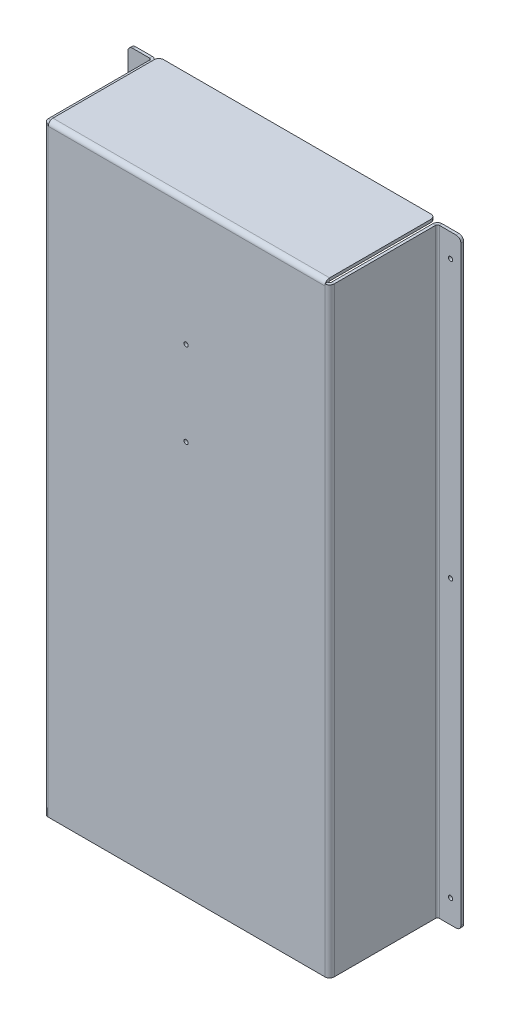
ISO-10303-21;
HEADER;
FILE_DESCRIPTION(('STEP AP214'),'2;1');
FILE_NAME('part.step','',(''),(''),'','','');
FILE_SCHEMA(('AUTOMOTIVE_DESIGN { 1 0 10303 214 1 1 1 1 }'));
ENDSEC;
DATA;
#1=APPLICATION_CONTEXT('core data for automotive mechanical design processes');
#2=APPLICATION_PROTOCOL_DEFINITION('international standard','automotive_design',2000,#1);
#3=PRODUCT_CONTEXT('',#1,'mechanical');
#4=PRODUCT('Part','Part','',(#3));
#5=PRODUCT_RELATED_PRODUCT_CATEGORY('part','',(#4));
#6=PRODUCT_DEFINITION_FORMATION('','',#4);
#7=PRODUCT_DEFINITION_CONTEXT('part definition',#1,'design');
#8=PRODUCT_DEFINITION('design','',#6,#7);
#9=PRODUCT_DEFINITION_SHAPE('','',#8);
#10=(LENGTH_UNIT() NAMED_UNIT(*) SI_UNIT(.MILLI.,.METRE.));
#11=(NAMED_UNIT(*) PLANE_ANGLE_UNIT() SI_UNIT($,.RADIAN.));
#12=(NAMED_UNIT(*) SI_UNIT($,.STERADIAN.) SOLID_ANGLE_UNIT());
#13=UNCERTAINTY_MEASURE_WITH_UNIT(LENGTH_MEASURE(1.E-05),#10,'distance_accuracy_value','');
#14=(GEOMETRIC_REPRESENTATION_CONTEXT(3) GLOBAL_UNCERTAINTY_ASSIGNED_CONTEXT((#13)) GLOBAL_UNIT_ASSIGNED_CONTEXT((#10,
#11,#12)) REPRESENTATION_CONTEXT('',''));
#15=CARTESIAN_POINT('',(0.,0.,0.));
#16=DIRECTION('',(0.,0.,1.));
#17=DIRECTION('',(1.,0.,0.));
#18=AXIS2_PLACEMENT_3D('',#15,#16,#17);
#19=CARTESIAN_POINT('',(265.,640.,-3.));
#20=DIRECTION('',(-1.,0.,0.));
#21=DIRECTION('',(0.,0.,1.));
#22=AXIS2_PLACEMENT_3D('',#19,#20,#21);
#23=PLANE('',#22);
#24=DIRECTION('',(0.,0.,-1.));
#25=VECTOR('',#24,1.);
#26=CARTESIAN_POINT('',(265.,640.,0.));
#27=LINE('',#26,#25);
#28=CARTESIAN_POINT('',(265.,640.,0.));
#29=VERTEX_POINT('',#28);
#30=CARTESIAN_POINT('',(265.,640.,-0.417424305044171));
#31=VERTEX_POINT('',#30);
#32=EDGE_CURVE('E550',#29,#31,#27,.T.);
#33=ORIENTED_EDGE('',*,*,#32,.T.);
#34=CARTESIAN_POINT('',(265.,638.,-5.00000000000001));
#35=DIRECTION('',(1.,0.,0.));
#36=DIRECTION('',(0.,0.,-1.));
#37=AXIS2_PLACEMENT_3D('',#34,#35,#36);
#38=CIRCLE('',#37,5.);
#39=CARTESIAN_POINT('',(265.,638.,0.));
#40=VERTEX_POINT('',#39);
#41=EDGE_CURVE('E307',#31,#40,#38,.T.);
#42=ORIENTED_EDGE('',*,*,#41,.T.);
#43=DIRECTION('',(0.,-1.,0.));
#44=VECTOR('',#43,1.);
#45=CARTESIAN_POINT('',(265.,640.,0.));
#46=LINE('',#45,#44);
#47=EDGE_CURVE('E502',#29,#40,#46,.T.);
#48=ORIENTED_EDGE('',*,*,#47,.F.);
#49=EDGE_LOOP('',(#33,#42,#48));
#50=FACE_BOUND('',#49,.T.);
#51=ADVANCED_FACE('F34',(#50),#23,.T.);
#52=CARTESIAN_POINT('',(-30.,638.,-3.00000000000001));
#53=DIRECTION('',(1.,0.,0.));
#54=DIRECTION('',(0.,1.,0.));
#55=AXIS2_PLACEMENT_3D('',#52,#53,#54);
#56=PLANE('',#55);
#57=DIRECTION('',(0.,-1.,0.));
#58=VECTOR('',#57,1.);
#59=CARTESIAN_POINT('',(-30.,640.,0.));
#60=LINE('',#59,#58);
#61=CARTESIAN_POINT('',(-30.,640.,0.));
#62=VERTEX_POINT('',#61);
#63=CARTESIAN_POINT('',(-30.,638.,0.));
#64=VERTEX_POINT('',#63);
#65=EDGE_CURVE('E506',#62,#64,#60,.T.);
#66=ORIENTED_EDGE('',*,*,#65,.T.);
#67=CARTESIAN_POINT('',(-30.,638.,-5.00000000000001));
#68=DIRECTION('',(1.,0.,0.));
#69=DIRECTION('',(0.,0.,-1.));
#70=AXIS2_PLACEMENT_3D('',#67,#68,#69);
#71=CIRCLE('',#70,5.);
#72=CARTESIAN_POINT('',(-30.,640.,-0.417424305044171));
#73=VERTEX_POINT('',#72);
#74=EDGE_CURVE('E355',#64,#73,#71,.F.);
#75=ORIENTED_EDGE('',*,*,#74,.T.);
#76=DIRECTION('',(0.,0.,1.));
#77=VECTOR('',#76,1.);
#78=CARTESIAN_POINT('',(-30.,640.,-3.));
#79=LINE('',#78,#77);
#80=EDGE_CURVE('E536',#73,#62,#79,.T.);
#81=ORIENTED_EDGE('',*,*,#80,.T.);
#82=EDGE_LOOP('',(#66,#75,#81));
#83=FACE_BOUND('',#82,.T.);
#84=ADVANCED_FACE('F757',(#83),#56,.T.);
#85=CARTESIAN_POINT('',(-35.,640.,0.));
#86=DIRECTION('',(0.,0.,1.));
#87=DIRECTION('',(1.,0.,0.));
#88=AXIS2_PLACEMENT_3D('',#85,#86,#87);
#89=PLANE('',#88);
#90=CARTESIAN_POINT('',(116.999850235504,420.004700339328,0.));
#91=DIRECTION('',(0.,0.,1.));
#92=DIRECTION('',(1.,0.,0.));
#93=AXIS2_PLACEMENT_3D('',#90,#91,#92);
#94=CIRCLE('',#93,2.25);
#95=CARTESIAN_POINT('',(119.249850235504,420.004700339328,0.));
#96=VERTEX_POINT('',#95);
#97=EDGE_CURVE('E587',#96,#96,#94,.T.);
#98=ORIENTED_EDGE('',*,*,#97,.F.);
#99=EDGE_LOOP('',(#98));
#100=FACE_BOUND('',#99,.T.);
#101=CARTESIAN_POINT('',(117.005670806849,510.004700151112,0.));
#102=DIRECTION('',(0.,0.,1.));
#103=DIRECTION('',(1.,0.,0.));
#104=AXIS2_PLACEMENT_3D('',#101,#102,#103);
#105=CIRCLE('',#104,2.25);
#106=CARTESIAN_POINT('',(119.255670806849,510.004700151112,0.));
#107=VERTEX_POINT('',#106);
#108=EDGE_CURVE('E586',#107,#107,#105,.T.);
#109=ORIENTED_EDGE('',*,*,#108,.F.);
#110=EDGE_LOOP('',(#109));
#111=FACE_BOUND('',#110,.T.);
#112=CARTESIAN_POINT('',(265.,0.,0.));
#113=VERTEX_POINT('',#112);
#114=EDGE_CURVE('E501',#40,#113,#46,.T.);
#115=ORIENTED_EDGE('',*,*,#114,.F.);
#116=DIRECTION('',(1.,0.,0.));
#117=VECTOR('',#116,1.);
#118=CARTESIAN_POINT('',(265.,638.,0.));
#119=LINE('',#118,#117);
#120=EDGE_CURVE('E310',#40,#64,#119,.F.);
#121=ORIENTED_EDGE('',*,*,#120,.T.);
#122=CARTESIAN_POINT('',(-30.,0.,0.));
#123=VERTEX_POINT('',#122);
#124=EDGE_CURVE('E505',#64,#123,#60,.T.);
#125=ORIENTED_EDGE('',*,*,#124,.T.);
#126=DIRECTION('',(-1.,0.,0.));
#127=VECTOR('',#126,1.);
#128=CARTESIAN_POINT('',(-35.,0.,0.));
#129=LINE('',#128,#127);
#130=EDGE_CURVE('E426',#113,#123,#129,.T.);
#131=ORIENTED_EDGE('',*,*,#130,.F.);
#132=EDGE_LOOP('',(#115,#121,#125,#131));
#133=FACE_BOUND('',#132,.T.);
#134=ADVANCED_FACE('F763',(#100,#111,#133),#89,.T.);
#135=CARTESIAN_POINT('',(-35.,640.,-3.));
#136=DIRECTION('',(0.,0.,1.));
#137=DIRECTION('',(1.,0.,0.));
#138=AXIS2_PLACEMENT_3D('',#135,#136,#137);
#139=PLANE('',#138);
#140=CARTESIAN_POINT('',(116.999850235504,420.004700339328,-3.));
#141=DIRECTION('',(0.,0.,1.));
#142=DIRECTION('',(1.,0.,0.));
#143=AXIS2_PLACEMENT_3D('',#140,#141,#142);
#144=CIRCLE('',#143,2.25);
#145=CARTESIAN_POINT('',(119.249850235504,420.004700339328,-3.));
#146=VERTEX_POINT('',#145);
#147=EDGE_CURVE('E583',#146,#146,#144,.T.);
#148=ORIENTED_EDGE('',*,*,#147,.T.);
#149=EDGE_LOOP('',(#148));
#150=FACE_BOUND('',#149,.T.);
#151=CARTESIAN_POINT('',(117.005670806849,510.004700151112,-3.));
#152=DIRECTION('',(0.,0.,1.));
#153=DIRECTION('',(1.,0.,0.));
#154=AXIS2_PLACEMENT_3D('',#151,#152,#153);
#155=CIRCLE('',#154,2.25);
#156=CARTESIAN_POINT('',(119.255670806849,510.004700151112,-3.));
#157=VERTEX_POINT('',#156);
#158=EDGE_CURVE('E1573',#157,#157,#155,.T.);
#159=ORIENTED_EDGE('',*,*,#158,.T.);
#160=EDGE_LOOP('',(#159));
#161=FACE_BOUND('',#160,.T.);
#162=DIRECTION('',(1.,0.,0.));
#163=VECTOR('',#162,1.);
#164=CARTESIAN_POINT('',(265.,638.,-3.00000000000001));
#165=LINE('',#164,#163);
#166=CARTESIAN_POINT('',(265.,638.,-3.00000000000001));
#167=VERTEX_POINT('',#166);
#168=CARTESIAN_POINT('',(-30.,638.,-3.));
#169=VERTEX_POINT('',#168);
#170=EDGE_CURVE('E361',#167,#169,#165,.F.);
#171=ORIENTED_EDGE('',*,*,#170,.F.);
#172=DIRECTION('',(0.,-1.,0.));
#173=VECTOR('',#172,1.);
#174=CARTESIAN_POINT('',(265.,640.,-3.));
#175=LINE('',#174,#173);
#176=CARTESIAN_POINT('',(265.,0.,-3.));
#177=VERTEX_POINT('',#176);
#178=EDGE_CURVE('E474',#167,#177,#175,.T.);
#179=ORIENTED_EDGE('',*,*,#178,.T.);
#180=DIRECTION('',(1.,0.,0.));
#181=VECTOR('',#180,1.);
#182=CARTESIAN_POINT('',(-35.,0.,-3.));
#183=LINE('',#182,#181);
#184=CARTESIAN_POINT('',(-30.,0.,-3.));
#185=VERTEX_POINT('',#184);
#186=EDGE_CURVE('E451',#177,#185,#183,.F.);
#187=ORIENTED_EDGE('',*,*,#186,.T.);
#188=DIRECTION('',(0.,-1.,0.));
#189=VECTOR('',#188,1.);
#190=CARTESIAN_POINT('',(-30.,640.,-3.));
#191=LINE('',#190,#189);
#192=EDGE_CURVE('E470',#169,#185,#191,.T.);
#193=ORIENTED_EDGE('',*,*,#192,.F.);
#194=EDGE_LOOP('',(#171,#179,#187,#193));
#195=FACE_BOUND('',#194,.T.);
#196=ADVANCED_FACE('F787',(#150,#161,#195),#139,.F.);
#197=CARTESIAN_POINT('',(270.,640.,-113.));
#198=DIRECTION('',(0.,1.,0.));
#199=DIRECTION('',(0.,0.,1.));
#200=AXIS2_PLACEMENT_3D('',#197,#198,#199);
#201=PLANE('',#200);
#202=DIRECTION('',(-1.,0.,0.));
#203=VECTOR('',#202,1.);
#204=CARTESIAN_POINT('',(270.,640.,-113.));
#205=LINE('',#204,#203);
#206=CARTESIAN_POINT('',(270.,640.,-113.));
#207=VERTEX_POINT('',#206);
#208=CARTESIAN_POINT('',(267.,640.,-113.));
#209=VERTEX_POINT('',#208);
#210=EDGE_CURVE('E561',#207,#209,#205,.T.);
#211=ORIENTED_EDGE('',*,*,#210,.F.);
#212=CARTESIAN_POINT('',(272.,640.,-113.));
#213=DIRECTION('',(0.,-1.,0.));
#214=DIRECTION('',(0.,0.,-1.));
#215=AXIS2_PLACEMENT_3D('',#212,#213,#214);
#216=CIRCLE('',#215,2.);
#217=CARTESIAN_POINT('',(272.,640.,-115.));
#218=VERTEX_POINT('',#217);
#219=EDGE_CURVE('E387',#218,#207,#216,.F.);
#220=ORIENTED_EDGE('',*,*,#219,.F.);
#221=DIRECTION('',(0.,0.,1.));
#222=VECTOR('',#221,1.);
#223=CARTESIAN_POINT('',(272.,640.,-118.));
#224=LINE('',#223,#222);
#225=CARTESIAN_POINT('',(272.,640.,-118.));
#226=VERTEX_POINT('',#225);
#227=EDGE_CURVE('E558',#226,#218,#224,.T.);
#228=ORIENTED_EDGE('',*,*,#227,.F.);
#229=CARTESIAN_POINT('',(272.,640.,-113.));
#230=DIRECTION('',(0.,1.,0.));
#231=DIRECTION('',(1.,0.,0.));
#232=AXIS2_PLACEMENT_3D('',#229,#230,#231);
#233=CIRCLE('',#232,5.);
#234=EDGE_CURVE('E394',#226,#209,#233,.T.);
#235=ORIENTED_EDGE('',*,*,#234,.T.);
#236=EDGE_LOOP('',(#211,#220,#228,#235));
#237=FACE_BOUND('',#236,.T.);
#238=ADVANCED_FACE('F790',(#237),#201,.T.);
#239=CARTESIAN_POINT('',(272.,640.,-118.));
#240=DIRECTION('',(0.,1.,0.));
#241=DIRECTION('',(0.,0.,1.));
#242=AXIS2_PLACEMENT_3D('',#239,#240,#241);
#243=PLANE('',#242);
#244=DIRECTION('',(0.,0.,1.));
#245=VECTOR('',#244,1.);
#246=CARTESIAN_POINT('',(270.,640.,0.));
#247=LINE('',#246,#245);
#248=CARTESIAN_POINT('',(270.,640.,-5.));
#249=VERTEX_POINT('',#248);
#250=EDGE_CURVE('E384',#207,#249,#247,.T.);
#251=ORIENTED_EDGE('',*,*,#250,.F.);
#252=ORIENTED_EDGE('',*,*,#210,.T.);
#253=DIRECTION('',(0.,0.,-1.));
#254=VECTOR('',#253,1.);
#255=CARTESIAN_POINT('',(267.,640.,0.));
#256=LINE('',#255,#254);
#257=CARTESIAN_POINT('',(267.,640.,-5.));
#258=VERTEX_POINT('',#257);
#259=EDGE_CURVE('E397',#209,#258,#256,.F.);
#260=ORIENTED_EDGE('',*,*,#259,.T.);
#261=DIRECTION('',(1.,0.,0.));
#262=VECTOR('',#261,1.);
#263=CARTESIAN_POINT('',(267.,640.,-5.));
#264=LINE('',#263,#262);
#265=EDGE_CURVE('E547',#258,#249,#264,.T.);
#266=ORIENTED_EDGE('',*,*,#265,.T.);
#267=EDGE_LOOP('',(#251,#252,#260,#266));
#268=FACE_BOUND('',#267,.T.);
#269=ADVANCED_FACE('F903',(#268),#243,.T.);
#270=CARTESIAN_POINT('',(272.,0.,-115.));
#271=DIRECTION('',(0.,-1.,0.));
#272=DIRECTION('',(0.,0.,-1.));
#273=AXIS2_PLACEMENT_3D('',#270,#271,#272);
#274=PLANE('',#273);
#275=DIRECTION('',(0.,0.,-1.));
#276=VECTOR('',#275,1.);
#277=CARTESIAN_POINT('',(272.,0.,-115.));
#278=LINE('',#277,#276);
#279=CARTESIAN_POINT('',(272.,0.,-115.));
#280=VERTEX_POINT('',#279);
#281=CARTESIAN_POINT('',(272.,0.,-118.));
#282=VERTEX_POINT('',#281);
#283=EDGE_CURVE('E555',#280,#282,#278,.T.);
#284=ORIENTED_EDGE('',*,*,#283,.F.);
#285=CARTESIAN_POINT('',(272.,0.,-113.));
#286=DIRECTION('',(0.,-1.,0.));
#287=DIRECTION('',(0.,0.,-1.));
#288=AXIS2_PLACEMENT_3D('',#285,#286,#287);
#289=CIRCLE('',#288,2.);
#290=CARTESIAN_POINT('',(270.,0.,-113.));
#291=VERTEX_POINT('',#290);
#292=EDGE_CURVE('E435',#280,#291,#289,.F.);
#293=ORIENTED_EDGE('',*,*,#292,.T.);
#294=DIRECTION('',(1.,0.,0.));
#295=VECTOR('',#294,1.);
#296=CARTESIAN_POINT('',(267.,0.,-113.));
#297=LINE('',#296,#295);
#298=CARTESIAN_POINT('',(267.,0.,-113.));
#299=VERTEX_POINT('',#298);
#300=EDGE_CURVE('E553',#299,#291,#297,.T.);
#301=ORIENTED_EDGE('',*,*,#300,.F.);
#302=CARTESIAN_POINT('',(272.,0.,-113.));
#303=DIRECTION('',(0.,1.,0.));
#304=DIRECTION('',(1.,0.,0.));
#305=AXIS2_PLACEMENT_3D('',#302,#303,#304);
#306=CIRCLE('',#305,5.);
#307=EDGE_CURVE('E442',#282,#299,#306,.T.);
#308=ORIENTED_EDGE('',*,*,#307,.F.);
#309=EDGE_LOOP('',(#284,#293,#301,#308));
#310=FACE_BOUND('',#309,.T.);
#311=ADVANCED_FACE('F899',(#310),#274,.T.);
#312=CARTESIAN_POINT('',(267.,0.,-113.));
#313=DIRECTION('',(0.,-1.,0.));
#314=DIRECTION('',(0.,0.,-1.));
#315=AXIS2_PLACEMENT_3D('',#312,#313,#314);
#316=PLANE('',#315);
#317=DIRECTION('',(-1.,0.,0.));
#318=VECTOR('',#317,1.);
#319=CARTESIAN_POINT('',(270.,0.,-118.));
#320=LINE('',#319,#318);
#321=CARTESIAN_POINT('',(290.,0.,-118.));
#322=VERTEX_POINT('',#321);
#323=EDGE_CURVE('E440',#322,#282,#320,.T.);
#324=ORIENTED_EDGE('',*,*,#323,.F.);
#325=DIRECTION('',(0.,0.,1.));
#326=VECTOR('',#325,1.);
#327=CARTESIAN_POINT('',(290.,0.,-113.));
#328=LINE('',#327,#326);
#329=CARTESIAN_POINT('',(290.,0.,-115.));
#330=VERTEX_POINT('',#329);
#331=EDGE_CURVE('E619',#322,#330,#328,.T.);
#332=ORIENTED_EDGE('',*,*,#331,.T.);
#333=DIRECTION('',(-1.,0.,0.));
#334=VECTOR('',#333,1.);
#335=CARTESIAN_POINT('',(270.,0.,-115.));
#336=LINE('',#335,#334);
#337=EDGE_CURVE('E438',#330,#280,#336,.T.);
#338=ORIENTED_EDGE('',*,*,#337,.T.);
#339=ORIENTED_EDGE('',*,*,#283,.T.);
#340=EDGE_LOOP('',(#324,#332,#338,#339));
#341=FACE_BOUND('',#340,.T.);
#342=ADVANCED_FACE('F895',(#341),#316,.T.);
#343=CARTESIAN_POINT('',(265.,640.,0.));
#344=DIRECTION('',(0.,1.,0.));
#345=DIRECTION('',(0.,0.,1.));
#346=AXIS2_PLACEMENT_3D('',#343,#344,#345);
#347=PLANE('',#346);
#348=ORIENTED_EDGE('',*,*,#32,.F.);
#349=CARTESIAN_POINT('',(265.,640.,-5.));
#350=DIRECTION('',(0.,1.,0.));
#351=DIRECTION('',(0.,0.,1.));
#352=AXIS2_PLACEMENT_3D('',#349,#350,#351);
#353=CIRCLE('',#352,5.);
#354=EDGE_CURVE('E381',#249,#29,#353,.F.);
#355=ORIENTED_EDGE('',*,*,#354,.F.);
#356=ORIENTED_EDGE('',*,*,#265,.F.);
#357=CARTESIAN_POINT('',(265.,640.,-5.));
#358=DIRECTION('',(0.,1.,0.));
#359=DIRECTION('',(1.,0.,0.));
#360=AXIS2_PLACEMENT_3D('',#357,#358,#359);
#361=CIRCLE('',#360,2.);
#362=CARTESIAN_POINT('',(265.,640.,-3.));
#363=VERTEX_POINT('',#362);
#364=EDGE_CURVE('E400',#258,#363,#361,.F.);
#365=ORIENTED_EDGE('',*,*,#364,.T.);
#366=EDGE_CURVE('E549',#31,#363,#27,.T.);
#367=ORIENTED_EDGE('',*,*,#366,.F.);
#368=EDGE_LOOP('',(#348,#355,#356,#365,#367));
#369=FACE_BOUND('',#368,.T.);
#370=ADVANCED_FACE('F891',(#369),#347,.T.);
#371=CARTESIAN_POINT('',(270.,0.,-5.));
#372=DIRECTION('',(0.,-1.,0.));
#373=DIRECTION('',(0.,0.,-1.));
#374=AXIS2_PLACEMENT_3D('',#371,#372,#373);
#375=PLANE('',#374);
#376=DIRECTION('',(-1.,0.,0.));
#377=VECTOR('',#376,1.);
#378=CARTESIAN_POINT('',(270.,0.,-5.));
#379=LINE('',#378,#377);
#380=CARTESIAN_POINT('',(270.,0.,-5.));
#381=VERTEX_POINT('',#380);
#382=CARTESIAN_POINT('',(267.,0.,-5.));
#383=VERTEX_POINT('',#382);
#384=EDGE_CURVE('E545',#381,#383,#379,.T.);
#385=ORIENTED_EDGE('',*,*,#384,.F.);
#386=CARTESIAN_POINT('',(265.,0.,-5.));
#387=DIRECTION('',(0.,1.,0.));
#388=DIRECTION('',(0.,0.,1.));
#389=AXIS2_PLACEMENT_3D('',#386,#387,#388);
#390=CIRCLE('',#389,5.);
#391=EDGE_CURVE('E429',#381,#113,#390,.F.);
#392=ORIENTED_EDGE('',*,*,#391,.T.);
#393=DIRECTION('',(0.,0.,1.));
#394=VECTOR('',#393,1.);
#395=CARTESIAN_POINT('',(265.,0.,-3.));
#396=LINE('',#395,#394);
#397=EDGE_CURVE('E542',#177,#113,#396,.T.);
#398=ORIENTED_EDGE('',*,*,#397,.F.);
#399=CARTESIAN_POINT('',(265.,0.,-5.));
#400=DIRECTION('',(0.,1.,0.));
#401=DIRECTION('',(1.,0.,0.));
#402=AXIS2_PLACEMENT_3D('',#399,#400,#401);
#403=CIRCLE('',#402,2.);
#404=EDGE_CURVE('E448',#383,#177,#403,.F.);
#405=ORIENTED_EDGE('',*,*,#404,.F.);
#406=EDGE_LOOP('',(#385,#392,#398,#405));
#407=FACE_BOUND('',#406,.T.);
#408=ADVANCED_FACE('F887',(#407),#375,.T.);
#409=CARTESIAN_POINT('',(265.,0.,-3.));
#410=DIRECTION('',(0.,-1.,0.));
#411=DIRECTION('',(0.,0.,-1.));
#412=AXIS2_PLACEMENT_3D('',#409,#410,#411);
#413=PLANE('',#412);
#414=DIRECTION('',(0.,0.,1.));
#415=VECTOR('',#414,1.);
#416=CARTESIAN_POINT('',(270.,0.,0.));
#417=LINE('',#416,#415);
#418=EDGE_CURVE('E432',#291,#381,#417,.T.);
#419=ORIENTED_EDGE('',*,*,#418,.T.);
#420=ORIENTED_EDGE('',*,*,#384,.T.);
#421=DIRECTION('',(0.,0.,-1.));
#422=VECTOR('',#421,1.);
#423=CARTESIAN_POINT('',(267.,0.,0.));
#424=LINE('',#423,#422);
#425=EDGE_CURVE('E445',#299,#383,#424,.F.);
#426=ORIENTED_EDGE('',*,*,#425,.F.);
#427=ORIENTED_EDGE('',*,*,#300,.T.);
#428=EDGE_LOOP('',(#419,#420,#426,#427));
#429=FACE_BOUND('',#428,.T.);
#430=ADVANCED_FACE('F883',(#429),#413,.T.);
#431=CARTESIAN_POINT('',(-35.,640.,-5.));
#432=DIRECTION('',(0.,1.,0.));
#433=DIRECTION('',(0.,0.,1.));
#434=AXIS2_PLACEMENT_3D('',#431,#432,#433);
#435=PLANE('',#434);
#436=DIRECTION('',(1.,0.,0.));
#437=VECTOR('',#436,1.);
#438=CARTESIAN_POINT('',(-35.,640.,-5.));
#439=LINE('',#438,#437);
#440=CARTESIAN_POINT('',(-35.,640.,-5.));
#441=VERTEX_POINT('',#440);
#442=CARTESIAN_POINT('',(-32.,640.,-5.));
#443=VERTEX_POINT('',#442);
#444=EDGE_CURVE('E540',#441,#443,#439,.T.);
#445=ORIENTED_EDGE('',*,*,#444,.F.);
#446=CARTESIAN_POINT('',(-30.,640.,-5.));
#447=DIRECTION('',(0.,1.,0.));
#448=DIRECTION('',(0.,0.,1.));
#449=AXIS2_PLACEMENT_3D('',#446,#447,#448);
#450=CIRCLE('',#449,5.);
#451=EDGE_CURVE('E378',#62,#441,#450,.F.);
#452=ORIENTED_EDGE('',*,*,#451,.F.);
#453=ORIENTED_EDGE('',*,*,#80,.F.);
#454=CARTESIAN_POINT('',(-30.,640.,-3.));
#455=VERTEX_POINT('',#454);
#456=EDGE_CURVE('E537',#455,#73,#79,.T.);
#457=ORIENTED_EDGE('',*,*,#456,.F.);
#458=CARTESIAN_POINT('',(-30.,640.,-5.));
#459=DIRECTION('',(0.,1.,0.));
#460=DIRECTION('',(1.,0.,0.));
#461=AXIS2_PLACEMENT_3D('',#458,#459,#460);
#462=CIRCLE('',#461,2.);
#463=EDGE_CURVE('E402',#455,#443,#462,.F.);
#464=ORIENTED_EDGE('',*,*,#463,.T.);
#465=EDGE_LOOP('',(#445,#452,#453,#457,#464));
#466=FACE_BOUND('',#465,.T.);
#467=ADVANCED_FACE('F879',(#466),#435,.T.);
#468=CARTESIAN_POINT('',(-30.,640.,-3.));
#469=DIRECTION('',(0.,1.,0.));
#470=DIRECTION('',(0.,0.,1.));
#471=AXIS2_PLACEMENT_3D('',#468,#469,#470);
#472=PLANE('',#471);
#473=DIRECTION('',(0.,0.,-1.));
#474=VECTOR('',#473,1.);
#475=CARTESIAN_POINT('',(-35.,640.,0.));
#476=LINE('',#475,#474);
#477=CARTESIAN_POINT('',(-35.,640.,-113.));
#478=VERTEX_POINT('',#477);
#479=EDGE_CURVE('E375',#441,#478,#476,.T.);
#480=ORIENTED_EDGE('',*,*,#479,.F.);
#481=ORIENTED_EDGE('',*,*,#444,.T.);
#482=DIRECTION('',(0.,0.,-1.));
#483=VECTOR('',#482,1.);
#484=CARTESIAN_POINT('',(-32.,640.,0.));
#485=LINE('',#484,#483);
#486=CARTESIAN_POINT('',(-32.,640.,-113.));
#487=VERTEX_POINT('',#486);
#488=EDGE_CURVE('E405',#443,#487,#485,.T.);
#489=ORIENTED_EDGE('',*,*,#488,.T.);
#490=DIRECTION('',(-1.,0.,0.));
#491=VECTOR('',#490,1.);
#492=CARTESIAN_POINT('',(-32.,640.,-113.));
#493=LINE('',#492,#491);
#494=EDGE_CURVE('E527',#487,#478,#493,.T.);
#495=ORIENTED_EDGE('',*,*,#494,.T.);
#496=EDGE_LOOP('',(#480,#481,#489,#495));
#497=FACE_BOUND('',#496,.T.);
#498=ADVANCED_FACE('F875',(#497),#472,.T.);
#499=CARTESIAN_POINT('',(-30.,0.,0.));
#500=DIRECTION('',(0.,-1.,0.));
#501=DIRECTION('',(0.,0.,-1.));
#502=AXIS2_PLACEMENT_3D('',#499,#500,#501);
#503=PLANE('',#502);
#504=DIRECTION('',(0.,0.,-1.));
#505=VECTOR('',#504,1.);
#506=CARTESIAN_POINT('',(-30.,0.,0.));
#507=LINE('',#506,#505);
#508=EDGE_CURVE('E533',#123,#185,#507,.T.);
#509=ORIENTED_EDGE('',*,*,#508,.F.);
#510=CARTESIAN_POINT('',(-30.,0.,-5.));
#511=DIRECTION('',(0.,1.,0.));
#512=DIRECTION('',(0.,0.,1.));
#513=AXIS2_PLACEMENT_3D('',#510,#511,#512);
#514=CIRCLE('',#513,5.);
#515=CARTESIAN_POINT('',(-35.,0.,-5.));
#516=VERTEX_POINT('',#515);
#517=EDGE_CURVE('E423',#123,#516,#514,.F.);
#518=ORIENTED_EDGE('',*,*,#517,.T.);
#519=DIRECTION('',(-1.,0.,0.));
#520=VECTOR('',#519,1.);
#521=CARTESIAN_POINT('',(-32.,0.,-5.));
#522=LINE('',#521,#520);
#523=CARTESIAN_POINT('',(-32.,0.,-5.));
#524=VERTEX_POINT('',#523);
#525=EDGE_CURVE('E531',#524,#516,#522,.T.);
#526=ORIENTED_EDGE('',*,*,#525,.F.);
#527=CARTESIAN_POINT('',(-30.,0.,-5.));
#528=DIRECTION('',(0.,1.,0.));
#529=DIRECTION('',(1.,0.,0.));
#530=AXIS2_PLACEMENT_3D('',#527,#528,#529);
#531=CIRCLE('',#530,2.);
#532=EDGE_CURVE('E454',#185,#524,#531,.F.);
#533=ORIENTED_EDGE('',*,*,#532,.F.);
#534=EDGE_LOOP('',(#509,#518,#526,#533));
#535=FACE_BOUND('',#534,.T.);
#536=ADVANCED_FACE('F871',(#535),#503,.T.);
#537=CARTESIAN_POINT('',(-32.,0.,-5.));
#538=DIRECTION('',(0.,-1.,0.));
#539=DIRECTION('',(0.,0.,-1.));
#540=AXIS2_PLACEMENT_3D('',#537,#538,#539);
#541=PLANE('',#540);
#542=ORIENTED_EDGE('',*,*,#130,.T.);
#543=ORIENTED_EDGE('',*,*,#508,.T.);
#544=ORIENTED_EDGE('',*,*,#186,.F.);
#545=ORIENTED_EDGE('',*,*,#397,.T.);
#546=EDGE_LOOP('',(#542,#543,#544,#545));
#547=FACE_BOUND('',#546,.T.);
#548=ADVANCED_FACE('F867',(#547),#541,.T.);
#549=CARTESIAN_POINT('',(-37.,640.,-115.));
#550=DIRECTION('',(0.,1.,0.));
#551=DIRECTION('',(0.,0.,1.));
#552=AXIS2_PLACEMENT_3D('',#549,#550,#551);
#553=PLANE('',#552);
#554=DIRECTION('',(0.,0.,-1.));
#555=VECTOR('',#554,1.);
#556=CARTESIAN_POINT('',(-37.,640.,-115.));
#557=LINE('',#556,#555);
#558=CARTESIAN_POINT('',(-37.,640.,-115.));
#559=VERTEX_POINT('',#558);
#560=CARTESIAN_POINT('',(-37.,640.,-118.));
#561=VERTEX_POINT('',#560);
#562=EDGE_CURVE('E529',#559,#561,#557,.T.);
#563=ORIENTED_EDGE('',*,*,#562,.F.);
#564=CARTESIAN_POINT('',(-37.,640.,-113.));
#565=DIRECTION('',(0.,-1.,0.));
#566=DIRECTION('',(0.,0.,-1.));
#567=AXIS2_PLACEMENT_3D('',#564,#565,#566);
#568=CIRCLE('',#567,2.);
#569=EDGE_CURVE('E372',#478,#559,#568,.F.);
#570=ORIENTED_EDGE('',*,*,#569,.F.);
#571=ORIENTED_EDGE('',*,*,#494,.F.);
#572=CARTESIAN_POINT('',(-37.,640.,-113.));
#573=DIRECTION('',(0.,1.,0.));
#574=DIRECTION('',(1.,0.,0.));
#575=AXIS2_PLACEMENT_3D('',#572,#573,#574);
#576=CIRCLE('',#575,5.);
#577=EDGE_CURVE('E408',#487,#561,#576,.T.);
#578=ORIENTED_EDGE('',*,*,#577,.T.);
#579=EDGE_LOOP('',(#563,#570,#571,#578));
#580=FACE_BOUND('',#579,.T.);
#581=ADVANCED_FACE('F863',(#580),#553,.T.);
#582=CARTESIAN_POINT('',(-32.,640.,-113.));
#583=DIRECTION('',(0.,1.,0.));
#584=DIRECTION('',(0.,0.,1.));
#585=AXIS2_PLACEMENT_3D('',#582,#583,#584);
#586=PLANE('',#585);
#587=DIRECTION('',(1.,0.,0.));
#588=VECTOR('',#587,1.);
#589=CARTESIAN_POINT('',(-35.,640.,-118.));
#590=LINE('',#589,#588);
#591=CARTESIAN_POINT('',(-55.,640.,-118.));
#592=VERTEX_POINT('',#591);
#593=EDGE_CURVE('E365',#561,#592,#590,.F.);
#594=ORIENTED_EDGE('',*,*,#593,.T.);
#595=DIRECTION('',(0.,0.,-1.));
#596=VECTOR('',#595,1.);
#597=CARTESIAN_POINT('',(-55.,640.,-113.));
#598=LINE('',#597,#596);
#599=CARTESIAN_POINT('',(-55.,640.,-115.));
#600=VERTEX_POINT('',#599);
#601=EDGE_CURVE('E638',#592,#600,#598,.F.);
#602=ORIENTED_EDGE('',*,*,#601,.T.);
#603=DIRECTION('',(-1.,0.,0.));
#604=VECTOR('',#603,1.);
#605=CARTESIAN_POINT('',(-35.,640.,-115.));
#606=LINE('',#605,#604);
#607=EDGE_CURVE('E368',#559,#600,#606,.T.);
#608=ORIENTED_EDGE('',*,*,#607,.F.);
#609=ORIENTED_EDGE('',*,*,#562,.T.);
#610=EDGE_LOOP('',(#594,#602,#608,#609));
#611=FACE_BOUND('',#610,.T.);
#612=ADVANCED_FACE('F859',(#611),#586,.T.);
#613=CARTESIAN_POINT('',(-35.,0.,-113.));
#614=DIRECTION('',(0.,-1.,0.));
#615=DIRECTION('',(0.,0.,-1.));
#616=AXIS2_PLACEMENT_3D('',#613,#614,#615);
#617=PLANE('',#616);
#618=DIRECTION('',(1.,0.,0.));
#619=VECTOR('',#618,1.);
#620=CARTESIAN_POINT('',(-35.,0.,-113.));
#621=LINE('',#620,#619);
#622=CARTESIAN_POINT('',(-35.,0.,-113.));
#623=VERTEX_POINT('',#622);
#624=CARTESIAN_POINT('',(-32.,0.,-113.));
#625=VERTEX_POINT('',#624);
#626=EDGE_CURVE('E525',#623,#625,#621,.T.);
#627=ORIENTED_EDGE('',*,*,#626,.F.);
#628=CARTESIAN_POINT('',(-37.,0.,-113.));
#629=DIRECTION('',(0.,-1.,0.));
#630=DIRECTION('',(0.,0.,-1.));
#631=AXIS2_PLACEMENT_3D('',#628,#629,#630);
#632=CIRCLE('',#631,2.);
#633=CARTESIAN_POINT('',(-37.,0.,-115.));
#634=VERTEX_POINT('',#633);
#635=EDGE_CURVE('E417',#623,#634,#632,.F.);
#636=ORIENTED_EDGE('',*,*,#635,.T.);
#637=DIRECTION('',(0.,0.,1.));
#638=VECTOR('',#637,1.);
#639=CARTESIAN_POINT('',(-37.,0.,-118.));
#640=LINE('',#639,#638);
#641=CARTESIAN_POINT('',(-37.,0.,-118.));
#642=VERTEX_POINT('',#641);
#643=EDGE_CURVE('E523',#642,#634,#640,.T.);
#644=ORIENTED_EDGE('',*,*,#643,.F.);
#645=CARTESIAN_POINT('',(-37.,0.,-113.));
#646=DIRECTION('',(0.,1.,0.));
#647=DIRECTION('',(1.,0.,0.));
#648=AXIS2_PLACEMENT_3D('',#645,#646,#647);
#649=CIRCLE('',#648,5.);
#650=EDGE_CURVE('E369',#625,#642,#649,.T.);
#651=ORIENTED_EDGE('',*,*,#650,.F.);
#652=EDGE_LOOP('',(#627,#636,#644,#651));
#653=FACE_BOUND('',#652,.T.);
#654=ADVANCED_FACE('F855',(#653),#617,.T.);
#655=CARTESIAN_POINT('',(-37.,0.,-118.));
#656=DIRECTION('',(0.,-1.,0.));
#657=DIRECTION('',(0.,0.,-1.));
#658=AXIS2_PLACEMENT_3D('',#655,#656,#657);
#659=PLANE('',#658);
#660=DIRECTION('',(0.,0.,-1.));
#661=VECTOR('',#660,1.);
#662=CARTESIAN_POINT('',(-35.,0.,0.));
#663=LINE('',#662,#661);
#664=EDGE_CURVE('E420',#516,#623,#663,.T.);
#665=ORIENTED_EDGE('',*,*,#664,.T.);
#666=ORIENTED_EDGE('',*,*,#626,.T.);
#667=DIRECTION('',(0.,0.,-1.));
#668=VECTOR('',#667,1.);
#669=CARTESIAN_POINT('',(-32.,0.,0.));
#670=LINE('',#669,#668);
#671=EDGE_CURVE('E457',#524,#625,#670,.T.);
#672=ORIENTED_EDGE('',*,*,#671,.F.);
#673=ORIENTED_EDGE('',*,*,#525,.T.);
#674=EDGE_LOOP('',(#665,#666,#672,#673));
#675=FACE_BOUND('',#674,.T.);
#676=ADVANCED_FACE('F851',(#675),#659,.T.);
#677=CARTESIAN_POINT('',(-35.,640.,-118.));
#678=DIRECTION('',(0.,0.,1.));
#679=DIRECTION('',(1.,0.,0.));
#680=AXIS2_PLACEMENT_3D('',#677,#678,#679);
#681=PLANE('',#680);
#682=CARTESIAN_POINT('',(-49.,615.,-118.));
#683=DIRECTION('',(0.,0.,1.));
#684=DIRECTION('',(1.,0.,0.));
#685=AXIS2_PLACEMENT_3D('',#682,#683,#684);
#686=CIRCLE('',#685,2.24999999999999);
#687=CARTESIAN_POINT('',(-46.75,615.,-118.));
#688=VERTEX_POINT('',#687);
#689=EDGE_CURVE('E1567',#688,#688,#686,.T.);
#690=ORIENTED_EDGE('',*,*,#689,.T.);
#691=EDGE_LOOP('',(#690));
#692=FACE_BOUND('',#691,.T.);
#693=CARTESIAN_POINT('',(-49.,320.,-118.));
#694=DIRECTION('',(0.,0.,1.));
#695=DIRECTION('',(1.,0.,0.));
#696=AXIS2_PLACEMENT_3D('',#693,#694,#695);
#697=CIRCLE('',#696,2.24999999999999);
#698=CARTESIAN_POINT('',(-46.75,320.,-118.));
#699=VERTEX_POINT('',#698);
#700=EDGE_CURVE('E1561',#699,#699,#697,.T.);
#701=ORIENTED_EDGE('',*,*,#700,.T.);
#702=EDGE_LOOP('',(#701));
#703=FACE_BOUND('',#702,.T.);
#704=CARTESIAN_POINT('',(-49.,25.,-118.));
#705=DIRECTION('',(0.,0.,1.));
#706=DIRECTION('',(1.,0.,0.));
#707=AXIS2_PLACEMENT_3D('',#704,#705,#706);
#708=CIRCLE('',#707,2.24999999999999);
#709=CARTESIAN_POINT('',(-46.75,25.,-118.));
#710=VERTEX_POINT('',#709);
#711=EDGE_CURVE('E1555',#710,#710,#708,.T.);
#712=ORIENTED_EDGE('',*,*,#711,.T.);
#713=EDGE_LOOP('',(#712));
#714=FACE_BOUND('',#713,.T.);
#715=DIRECTION('',(1.,0.,0.));
#716=VECTOR('',#715,1.);
#717=CARTESIAN_POINT('',(-35.,0.,-118.));
#718=LINE('',#717,#716);
#719=CARTESIAN_POINT('',(-55.,0.,-118.));
#720=VERTEX_POINT('',#719);
#721=EDGE_CURVE('E357',#642,#720,#718,.F.);
#722=ORIENTED_EDGE('',*,*,#721,.T.);
#723=CARTESIAN_POINT('',(-55.,5.,-118.));
#724=DIRECTION('',(0.,0.,1.));
#725=DIRECTION('',(1.,0.,0.));
#726=AXIS2_PLACEMENT_3D('',#723,#724,#725);
#727=CIRCLE('',#726,5.);
#728=CARTESIAN_POINT('',(-60.,5.,-118.));
#729=VERTEX_POINT('',#728);
#730=EDGE_CURVE('E627',#720,#729,#727,.F.);
#731=ORIENTED_EDGE('',*,*,#730,.T.);
#732=DIRECTION('',(0.,-1.,0.));
#733=VECTOR('',#732,1.);
#734=CARTESIAN_POINT('',(-60.,640.,-118.));
#735=LINE('',#734,#733);
#736=CARTESIAN_POINT('',(-60.,635.,-118.));
#737=VERTEX_POINT('',#736);
#738=EDGE_CURVE('E520',#737,#729,#735,.T.);
#739=ORIENTED_EDGE('',*,*,#738,.F.);
#740=CARTESIAN_POINT('',(-55.,635.,-118.));
#741=DIRECTION('',(0.,0.,1.));
#742=DIRECTION('',(1.,0.,0.));
#743=AXIS2_PLACEMENT_3D('',#740,#741,#742);
#744=CIRCLE('',#743,5.);
#745=EDGE_CURVE('E625',#737,#592,#744,.F.);
#746=ORIENTED_EDGE('',*,*,#745,.T.);
#747=ORIENTED_EDGE('',*,*,#593,.F.);
#748=DIRECTION('',(0.,-1.,0.));
#749=VECTOR('',#748,1.);
#750=CARTESIAN_POINT('',(-37.,640.,-118.));
#751=LINE('',#750,#749);
#752=EDGE_CURVE('E411',#561,#642,#751,.T.);
#753=ORIENTED_EDGE('',*,*,#752,.T.);
#754=EDGE_LOOP('',(#722,#731,#739,#746,#747,#753));
#755=FACE_BOUND('',#754,.T.);
#756=ADVANCED_FACE('F847',(#692,#703,#714,#755),#681,.F.);
#757=CARTESIAN_POINT('',(-60.,640.,-115.));
#758=DIRECTION('',(-1.,0.,0.));
#759=DIRECTION('',(0.,0.,1.));
#760=AXIS2_PLACEMENT_3D('',#757,#758,#759);
#761=PLANE('',#760);
#762=ORIENTED_EDGE('',*,*,#738,.T.);
#763=DIRECTION('',(0.,0.,-1.));
#764=VECTOR('',#763,1.);
#765=CARTESIAN_POINT('',(-60.,5.,-115.));
#766=LINE('',#765,#764);
#767=CARTESIAN_POINT('',(-60.,5.,-115.));
#768=VERTEX_POINT('',#767);
#769=EDGE_CURVE('E632',#729,#768,#766,.F.);
#770=ORIENTED_EDGE('',*,*,#769,.T.);
#771=DIRECTION('',(0.,-1.,0.));
#772=VECTOR('',#771,1.);
#773=CARTESIAN_POINT('',(-60.,640.,-115.));
#774=LINE('',#773,#772);
#775=CARTESIAN_POINT('',(-60.,635.,-115.));
#776=VERTEX_POINT('',#775);
#777=EDGE_CURVE('E517',#776,#768,#774,.T.);
#778=ORIENTED_EDGE('',*,*,#777,.F.);
#779=DIRECTION('',(0.,0.,-1.));
#780=VECTOR('',#779,1.);
#781=CARTESIAN_POINT('',(-60.,635.,-115.));
#782=LINE('',#781,#780);
#783=EDGE_CURVE('E629',#776,#737,#782,.T.);
#784=ORIENTED_EDGE('',*,*,#783,.T.);
#785=EDGE_LOOP('',(#762,#770,#778,#784));
#786=FACE_BOUND('',#785,.T.);
#787=ADVANCED_FACE('F843',(#786),#761,.T.);
#788=CARTESIAN_POINT('',(-35.,640.,-115.));
#789=DIRECTION('',(0.,0.,1.));
#790=DIRECTION('',(1.,0.,0.));
#791=AXIS2_PLACEMENT_3D('',#788,#789,#790);
#792=PLANE('',#791);
#793=CARTESIAN_POINT('',(-49.,615.,-115.));
#794=DIRECTION('',(0.,0.,1.));
#795=DIRECTION('',(1.,0.,0.));
#796=AXIS2_PLACEMENT_3D('',#793,#794,#795);
#797=CIRCLE('',#796,2.25);
#798=CARTESIAN_POINT('',(-46.75,615.,-115.));
#799=VERTEX_POINT('',#798);
#800=EDGE_CURVE('E1570',#799,#799,#797,.T.);
#801=ORIENTED_EDGE('',*,*,#800,.F.);
#802=EDGE_LOOP('',(#801));
#803=FACE_BOUND('',#802,.T.);
#804=CARTESIAN_POINT('',(-49.,320.,-115.));
#805=DIRECTION('',(0.,0.,1.));
#806=DIRECTION('',(1.,0.,0.));
#807=AXIS2_PLACEMENT_3D('',#804,#805,#806);
#808=CIRCLE('',#807,2.25);
#809=CARTESIAN_POINT('',(-46.75,320.,-115.));
#810=VERTEX_POINT('',#809);
#811=EDGE_CURVE('E1564',#810,#810,#808,.T.);
#812=ORIENTED_EDGE('',*,*,#811,.F.);
#813=EDGE_LOOP('',(#812));
#814=FACE_BOUND('',#813,.T.);
#815=CARTESIAN_POINT('',(-49.,25.,-115.));
#816=DIRECTION('',(0.,0.,1.));
#817=DIRECTION('',(1.,0.,0.));
#818=AXIS2_PLACEMENT_3D('',#815,#816,#817);
#819=CIRCLE('',#818,2.25);
#820=CARTESIAN_POINT('',(-46.75,25.,-115.));
#821=VERTEX_POINT('',#820);
#822=EDGE_CURVE('E1558',#821,#821,#819,.T.);
#823=ORIENTED_EDGE('',*,*,#822,.F.);
#824=EDGE_LOOP('',(#823));
#825=FACE_BOUND('',#824,.T.);
#826=ORIENTED_EDGE('',*,*,#777,.T.);
#827=CARTESIAN_POINT('',(-55.,5.,-115.));
#828=DIRECTION('',(0.,0.,1.));
#829=DIRECTION('',(1.,0.,0.));
#830=AXIS2_PLACEMENT_3D('',#827,#828,#829);
#831=CIRCLE('',#830,5.);
#832=CARTESIAN_POINT('',(-55.,0.,-115.));
#833=VERTEX_POINT('',#832);
#834=EDGE_CURVE('E636',#768,#833,#831,.T.);
#835=ORIENTED_EDGE('',*,*,#834,.T.);
#836=DIRECTION('',(-1.,0.,0.));
#837=VECTOR('',#836,1.);
#838=CARTESIAN_POINT('',(-35.,0.,-115.));
#839=LINE('',#838,#837);
#840=EDGE_CURVE('E414',#634,#833,#839,.T.);
#841=ORIENTED_EDGE('',*,*,#840,.F.);
#842=DIRECTION('',(0.,-1.,0.));
#843=VECTOR('',#842,1.);
#844=CARTESIAN_POINT('',(-37.,640.,-115.));
#845=LINE('',#844,#843);
#846=EDGE_CURVE('E514',#559,#634,#845,.T.);
#847=ORIENTED_EDGE('',*,*,#846,.F.);
#848=ORIENTED_EDGE('',*,*,#607,.T.);
#849=CARTESIAN_POINT('',(-55.,635.,-115.));
#850=DIRECTION('',(0.,0.,1.));
#851=DIRECTION('',(1.,0.,0.));
#852=AXIS2_PLACEMENT_3D('',#849,#850,#851);
#853=CIRCLE('',#852,5.);
#854=EDGE_CURVE('E634',#600,#776,#853,.T.);
#855=ORIENTED_EDGE('',*,*,#854,.T.);
#856=EDGE_LOOP('',(#826,#835,#841,#847,#848,#855));
#857=FACE_BOUND('',#856,.T.);
#858=ADVANCED_FACE('F839',(#803,#814,#825,#857),#792,.T.);
#859=CARTESIAN_POINT('',(-37.,640.,-113.));
#860=DIRECTION('',(0.,-1.,0.));
#861=DIRECTION('',(0.,0.,-1.));
#862=AXIS2_PLACEMENT_3D('',#859,#860,#861);
#863=CYLINDRICAL_SURFACE('',#862,2.);
#864=ORIENTED_EDGE('',*,*,#635,.F.);
#865=DIRECTION('',(0.,-1.,0.));
#866=VECTOR('',#865,1.);
#867=CARTESIAN_POINT('',(-35.,640.,-113.));
#868=LINE('',#867,#866);
#869=EDGE_CURVE('E511',#478,#623,#868,.T.);
#870=ORIENTED_EDGE('',*,*,#869,.F.);
#871=ORIENTED_EDGE('',*,*,#569,.T.);
#872=ORIENTED_EDGE('',*,*,#846,.T.);
#873=EDGE_LOOP('',(#864,#870,#871,#872));
#874=FACE_BOUND('',#873,.T.);
#875=ADVANCED_FACE('F836',(#874),#863,.F.);
#876=CARTESIAN_POINT('',(-35.,640.,0.));
#877=DIRECTION('',(-1.,0.,0.));
#878=DIRECTION('',(0.,0.,1.));
#879=AXIS2_PLACEMENT_3D('',#876,#877,#878);
#880=PLANE('',#879);
#881=DIRECTION('',(0.,-1.,0.));
#882=VECTOR('',#881,1.);
#883=CARTESIAN_POINT('',(-35.,570.,-80.));
#884=LINE('',#883,#882);
#885=CARTESIAN_POINT('',(-35.,565.,-80.));
#886=VERTEX_POINT('',#885);
#887=CARTESIAN_POINT('',(-35.,445.000000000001,-80.));
#888=VERTEX_POINT('',#887);
#889=EDGE_CURVE('E676',#886,#888,#884,.T.);
#890=ORIENTED_EDGE('',*,*,#889,.F.);
#891=CARTESIAN_POINT('',(-35.,565.,-75.));
#892=DIRECTION('',(-1.,0.,0.));
#893=DIRECTION('',(0.,0.,1.));
#894=AXIS2_PLACEMENT_3D('',#891,#892,#893);
#895=CIRCLE('',#894,5.);
#896=CARTESIAN_POINT('',(-35.,570.,-75.));
#897=VERTEX_POINT('',#896);
#898=EDGE_CURVE('E42',#886,#897,#895,.F.);
#899=ORIENTED_EDGE('',*,*,#898,.T.);
#900=DIRECTION('',(0.,0.,-1.));
#901=VECTOR('',#900,1.);
#902=CARTESIAN_POINT('',(-35.,570.,-80.));
#903=LINE('',#902,#901);
#904=CARTESIAN_POINT('',(-35.,570.,-35.));
#905=VERTEX_POINT('',#904);
#906=EDGE_CURVE('E674',#905,#897,#903,.T.);
#907=ORIENTED_EDGE('',*,*,#906,.F.);
#908=CARTESIAN_POINT('',(-35.,565.,-35.));
#909=DIRECTION('',(-1.,0.,0.));
#910=DIRECTION('',(0.,0.,1.));
#911=AXIS2_PLACEMENT_3D('',#908,#909,#910);
#912=CIRCLE('',#911,5.);
#913=CARTESIAN_POINT('',(-35.,565.,-30.));
#914=VERTEX_POINT('',#913);
#915=EDGE_CURVE('E667',#905,#914,#912,.F.);
#916=ORIENTED_EDGE('',*,*,#915,.T.);
#917=DIRECTION('',(0.,1.,0.));
#918=VECTOR('',#917,1.);
#919=CARTESIAN_POINT('',(-35.,570.,-30.));
#920=LINE('',#919,#918);
#921=CARTESIAN_POINT('',(-35.,445.000000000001,-30.));
#922=VERTEX_POINT('',#921);
#923=EDGE_CURVE('E682',#922,#914,#920,.T.);
#924=ORIENTED_EDGE('',*,*,#923,.F.);
#925=CARTESIAN_POINT('',(-35.,445.000000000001,-35.));
#926=DIRECTION('',(-1.,0.,0.));
#927=DIRECTION('',(0.,0.,1.));
#928=AXIS2_PLACEMENT_3D('',#925,#926,#927);
#929=CIRCLE('',#928,5.);
#930=CARTESIAN_POINT('',(-35.,440.000000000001,-35.));
#931=VERTEX_POINT('',#930);
#932=EDGE_CURVE('E663',#922,#931,#929,.F.);
#933=ORIENTED_EDGE('',*,*,#932,.T.);
#934=DIRECTION('',(0.,0.,1.));
#935=VECTOR('',#934,1.);
#936=CARTESIAN_POINT('',(-35.,440.000000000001,-80.));
#937=LINE('',#936,#935);
#938=CARTESIAN_POINT('',(-35.,440.000000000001,-75.));
#939=VERTEX_POINT('',#938);
#940=EDGE_CURVE('E702',#939,#931,#937,.T.);
#941=ORIENTED_EDGE('',*,*,#940,.F.);
#942=CARTESIAN_POINT('',(-35.,445.000000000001,-75.));
#943=DIRECTION('',(-1.,0.,0.));
#944=DIRECTION('',(0.,0.,1.));
#945=AXIS2_PLACEMENT_3D('',#942,#943,#944);
#946=CIRCLE('',#945,5.);
#947=EDGE_CURVE('E659',#939,#888,#946,.F.);
#948=ORIENTED_EDGE('',*,*,#947,.T.);
#949=EDGE_LOOP('',(#890,#899,#907,#916,#924,#933,#941,#948));
#950=FACE_BOUND('',#949,.T.);
#951=ORIENTED_EDGE('',*,*,#664,.F.);
#952=DIRECTION('',(0.,-1.,0.));
#953=VECTOR('',#952,1.);
#954=CARTESIAN_POINT('',(-35.,640.,-5.));
#955=LINE('',#954,#953);
#956=EDGE_CURVE('E508',#441,#516,#955,.T.);
#957=ORIENTED_EDGE('',*,*,#956,.F.);
#958=ORIENTED_EDGE('',*,*,#479,.T.);
#959=ORIENTED_EDGE('',*,*,#869,.T.);
#960=EDGE_LOOP('',(#951,#957,#958,#959));
#961=FACE_BOUND('',#960,.T.);
#962=ADVANCED_FACE('F672',(#950,#961),#880,.T.);
#963=CARTESIAN_POINT('',(-30.,640.,-5.));
#964=DIRECTION('',(0.,-1.,0.));
#965=DIRECTION('',(0.,0.,-1.));
#966=AXIS2_PLACEMENT_3D('',#963,#964,#965);
#967=CYLINDRICAL_SURFACE('',#966,5.);
#968=ORIENTED_EDGE('',*,*,#517,.F.);
#969=ORIENTED_EDGE('',*,*,#124,.F.);
#970=ORIENTED_EDGE('',*,*,#65,.F.);
#971=ORIENTED_EDGE('',*,*,#451,.T.);
#972=ORIENTED_EDGE('',*,*,#956,.T.);
#973=EDGE_LOOP('',(#968,#969,#970,#971,#972));
#974=FACE_BOUND('',#973,.T.);
#975=ADVANCED_FACE('F826',(#974),#967,.T.);
#976=CARTESIAN_POINT('',(265.,640.,-5.));
#977=DIRECTION('',(0.,-1.,0.));
#978=DIRECTION('',(0.,0.,-1.));
#979=AXIS2_PLACEMENT_3D('',#976,#977,#978);
#980=CYLINDRICAL_SURFACE('',#979,5.);
#981=ORIENTED_EDGE('',*,*,#391,.F.);
#982=DIRECTION('',(0.,-1.,0.));
#983=VECTOR('',#982,1.);
#984=CARTESIAN_POINT('',(270.,640.,-5.));
#985=LINE('',#984,#983);
#986=EDGE_CURVE('E498',#249,#381,#985,.T.);
#987=ORIENTED_EDGE('',*,*,#986,.F.);
#988=ORIENTED_EDGE('',*,*,#354,.T.);
#989=ORIENTED_EDGE('',*,*,#47,.T.);
#990=ORIENTED_EDGE('',*,*,#114,.T.);
#991=EDGE_LOOP('',(#981,#987,#988,#989,#990));
#992=FACE_BOUND('',#991,.T.);
#993=ADVANCED_FACE('F822',(#992),#980,.T.);
#994=CARTESIAN_POINT('',(270.,640.,0.));
#995=DIRECTION('',(1.,0.,0.));
#996=DIRECTION('',(0.,0.,-1.));
#997=AXIS2_PLACEMENT_3D('',#994,#995,#996);
#998=PLANE('',#997);
#999=ORIENTED_EDGE('',*,*,#418,.F.);
#1000=DIRECTION('',(0.,-1.,0.));
#1001=VECTOR('',#1000,1.);
#1002=CARTESIAN_POINT('',(270.,640.,-113.));
#1003=LINE('',#1002,#1001);
#1004=EDGE_CURVE('E495',#207,#291,#1003,.T.);
#1005=ORIENTED_EDGE('',*,*,#1004,.F.);
#1006=ORIENTED_EDGE('',*,*,#250,.T.);
#1007=ORIENTED_EDGE('',*,*,#986,.T.);
#1008=EDGE_LOOP('',(#999,#1005,#1006,#1007));
#1009=FACE_BOUND('',#1008,.T.);
#1010=ADVANCED_FACE('F818',(#1009),#998,.T.);
#1011=CARTESIAN_POINT('',(272.,640.,-113.));
#1012=DIRECTION('',(0.,-1.,0.));
#1013=DIRECTION('',(0.,0.,-1.));
#1014=AXIS2_PLACEMENT_3D('',#1011,#1012,#1013);
#1015=CYLINDRICAL_SURFACE('',#1014,2.);
#1016=ORIENTED_EDGE('',*,*,#292,.F.);
#1017=DIRECTION('',(0.,-1.,0.));
#1018=VECTOR('',#1017,1.);
#1019=CARTESIAN_POINT('',(272.,640.,-115.));
#1020=LINE('',#1019,#1018);
#1021=EDGE_CURVE('E492',#218,#280,#1020,.T.);
#1022=ORIENTED_EDGE('',*,*,#1021,.F.);
#1023=ORIENTED_EDGE('',*,*,#219,.T.);
#1024=ORIENTED_EDGE('',*,*,#1004,.T.);
#1025=EDGE_LOOP('',(#1016,#1022,#1023,#1024));
#1026=FACE_BOUND('',#1025,.T.);
#1027=ADVANCED_FACE('F814',(#1026),#1015,.F.);
#1028=CARTESIAN_POINT('',(270.,640.,-115.));
#1029=DIRECTION('',(0.,0.,1.));
#1030=DIRECTION('',(1.,0.,0.));
#1031=AXIS2_PLACEMENT_3D('',#1028,#1029,#1030);
#1032=PLANE('',#1031);
#1033=CARTESIAN_POINT('',(284.,25.,-115.));
#1034=DIRECTION('',(0.,0.,1.));
#1035=DIRECTION('',(1.,0.,0.));
#1036=AXIS2_PLACEMENT_3D('',#1033,#1034,#1035);
#1037=CIRCLE('',#1036,2.24999999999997);
#1038=CARTESIAN_POINT('',(286.25,25.,-115.));
#1039=VERTEX_POINT('',#1038);
#1040=EDGE_CURVE('E582',#1039,#1039,#1037,.T.);
#1041=ORIENTED_EDGE('',*,*,#1040,.F.);
#1042=EDGE_LOOP('',(#1041));
#1043=FACE_BOUND('',#1042,.T.);
#1044=CARTESIAN_POINT('',(284.,320.,-115.));
#1045=DIRECTION('',(0.,0.,1.));
#1046=DIRECTION('',(1.,0.,0.));
#1047=AXIS2_PLACEMENT_3D('',#1044,#1045,#1046);
#1048=CIRCLE('',#1047,2.24999999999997);
#1049=CARTESIAN_POINT('',(286.25,320.,-115.));
#1050=VERTEX_POINT('',#1049);
#1051=EDGE_CURVE('E578',#1050,#1050,#1048,.T.);
#1052=ORIENTED_EDGE('',*,*,#1051,.F.);
#1053=EDGE_LOOP('',(#1052));
#1054=FACE_BOUND('',#1053,.T.);
#1055=CARTESIAN_POINT('',(284.,615.,-115.));
#1056=DIRECTION('',(0.,0.,1.));
#1057=DIRECTION('',(1.,0.,0.));
#1058=AXIS2_PLACEMENT_3D('',#1055,#1056,#1057);
#1059=CIRCLE('',#1058,2.24999999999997);
#1060=CARTESIAN_POINT('',(286.25,615.,-115.));
#1061=VERTEX_POINT('',#1060);
#1062=EDGE_CURVE('E577',#1061,#1061,#1059,.T.);
#1063=ORIENTED_EDGE('',*,*,#1062,.F.);
#1064=EDGE_LOOP('',(#1063));
#1065=FACE_BOUND('',#1064,.T.);
#1066=DIRECTION('',(0.,-1.,0.));
#1067=VECTOR('',#1066,1.);
#1068=CARTESIAN_POINT('',(295.,640.,-115.));
#1069=LINE('',#1068,#1067);
#1070=CARTESIAN_POINT('',(295.,635.,-115.));
#1071=VERTEX_POINT('',#1070);
#1072=CARTESIAN_POINT('',(295.,5.,-115.));
#1073=VERTEX_POINT('',#1072);
#1074=EDGE_CURVE('E489',#1071,#1073,#1069,.T.);
#1075=ORIENTED_EDGE('',*,*,#1074,.F.);
#1076=CARTESIAN_POINT('',(290.,635.,-115.));
#1077=DIRECTION('',(0.,0.,1.));
#1078=DIRECTION('',(1.,0.,0.));
#1079=AXIS2_PLACEMENT_3D('',#1076,#1077,#1078);
#1080=CIRCLE('',#1079,5.);
#1081=CARTESIAN_POINT('',(290.,640.,-115.));
#1082=VERTEX_POINT('',#1081);
#1083=EDGE_CURVE('E611',#1071,#1082,#1080,.T.);
#1084=ORIENTED_EDGE('',*,*,#1083,.T.);
#1085=DIRECTION('',(-1.,0.,0.));
#1086=VECTOR('',#1085,1.);
#1087=CARTESIAN_POINT('',(270.,640.,-115.));
#1088=LINE('',#1087,#1086);
#1089=EDGE_CURVE('E390',#1082,#218,#1088,.T.);
#1090=ORIENTED_EDGE('',*,*,#1089,.T.);
#1091=ORIENTED_EDGE('',*,*,#1021,.T.);
#1092=ORIENTED_EDGE('',*,*,#337,.F.);
#1093=CARTESIAN_POINT('',(290.,5.,-115.));
#1094=DIRECTION('',(0.,0.,1.));
#1095=DIRECTION('',(1.,0.,0.));
#1096=AXIS2_PLACEMENT_3D('',#1093,#1094,#1095);
#1097=CIRCLE('',#1096,5.);
#1098=EDGE_CURVE('E609',#330,#1073,#1097,.T.);
#1099=ORIENTED_EDGE('',*,*,#1098,.T.);
#1100=EDGE_LOOP('',(#1075,#1084,#1090,#1091,#1092,#1099));
#1101=FACE_BOUND('',#1100,.T.);
#1102=ADVANCED_FACE('F810',(#1043,#1054,#1065,#1101),#1032,.T.);
#1103=CARTESIAN_POINT('',(295.,640.,-118.));
#1104=DIRECTION('',(1.,0.,0.));
#1105=DIRECTION('',(0.,0.,-1.));
#1106=AXIS2_PLACEMENT_3D('',#1103,#1104,#1105);
#1107=PLANE('',#1106);
#1108=DIRECTION('',(0.,-1.,0.));
#1109=VECTOR('',#1108,1.);
#1110=CARTESIAN_POINT('',(295.,640.,-118.));
#1111=LINE('',#1110,#1109);
#1112=CARTESIAN_POINT('',(295.,635.,-118.));
#1113=VERTEX_POINT('',#1112);
#1114=CARTESIAN_POINT('',(295.,5.,-118.));
#1115=VERTEX_POINT('',#1114);
#1116=EDGE_CURVE('E486',#1113,#1115,#1111,.T.);
#1117=ORIENTED_EDGE('',*,*,#1116,.F.);
#1118=DIRECTION('',(0.,0.,1.));
#1119=VECTOR('',#1118,1.);
#1120=CARTESIAN_POINT('',(295.,635.,-115.));
#1121=LINE('',#1120,#1119);
#1122=EDGE_CURVE('E606',#1113,#1071,#1121,.T.);
#1123=ORIENTED_EDGE('',*,*,#1122,.T.);
#1124=ORIENTED_EDGE('',*,*,#1074,.T.);
#1125=DIRECTION('',(0.,0.,1.));
#1126=VECTOR('',#1125,1.);
#1127=CARTESIAN_POINT('',(295.,5.,-118.));
#1128=LINE('',#1127,#1126);
#1129=EDGE_CURVE('E604',#1073,#1115,#1128,.F.);
#1130=ORIENTED_EDGE('',*,*,#1129,.T.);
#1131=EDGE_LOOP('',(#1117,#1123,#1124,#1130));
#1132=FACE_BOUND('',#1131,.T.);
#1133=ADVANCED_FACE('F806',(#1132),#1107,.T.);
#1134=CARTESIAN_POINT('',(270.,640.,-118.));
#1135=DIRECTION('',(0.,0.,1.));
#1136=DIRECTION('',(1.,0.,0.));
#1137=AXIS2_PLACEMENT_3D('',#1134,#1135,#1136);
#1138=PLANE('',#1137);
#1139=CARTESIAN_POINT('',(284.,25.,-118.));
#1140=DIRECTION('',(0.,0.,1.));
#1141=DIRECTION('',(1.,0.,0.));
#1142=AXIS2_PLACEMENT_3D('',#1139,#1140,#1141);
#1143=CIRCLE('',#1142,2.24999999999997);
#1144=CARTESIAN_POINT('',(286.25,25.,-118.));
#1145=VERTEX_POINT('',#1144);
#1146=EDGE_CURVE('E579',#1145,#1145,#1143,.T.);
#1147=ORIENTED_EDGE('',*,*,#1146,.T.);
#1148=EDGE_LOOP('',(#1147));
#1149=FACE_BOUND('',#1148,.T.);
#1150=CARTESIAN_POINT('',(284.,320.,-118.));
#1151=DIRECTION('',(0.,0.,1.));
#1152=DIRECTION('',(1.,0.,0.));
#1153=AXIS2_PLACEMENT_3D('',#1150,#1151,#1152);
#1154=CIRCLE('',#1153,2.24999999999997);
#1155=CARTESIAN_POINT('',(286.25,320.,-118.));
#1156=VERTEX_POINT('',#1155);
#1157=EDGE_CURVE('E574',#1156,#1156,#1154,.T.);
#1158=ORIENTED_EDGE('',*,*,#1157,.T.);
#1159=EDGE_LOOP('',(#1158));
#1160=FACE_BOUND('',#1159,.T.);
#1161=CARTESIAN_POINT('',(284.,615.,-118.));
#1162=DIRECTION('',(0.,0.,1.));
#1163=DIRECTION('',(1.,0.,0.));
#1164=AXIS2_PLACEMENT_3D('',#1161,#1162,#1163);
#1165=CIRCLE('',#1164,2.24999999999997);
#1166=CARTESIAN_POINT('',(286.25,615.,-118.));
#1167=VERTEX_POINT('',#1166);
#1168=EDGE_CURVE('E1546',#1167,#1167,#1165,.T.);
#1169=ORIENTED_EDGE('',*,*,#1168,.T.);
#1170=EDGE_LOOP('',(#1169));
#1171=FACE_BOUND('',#1170,.T.);
#1172=DIRECTION('',(-1.,0.,0.));
#1173=VECTOR('',#1172,1.);
#1174=CARTESIAN_POINT('',(270.,640.,-118.));
#1175=LINE('',#1174,#1173);
#1176=CARTESIAN_POINT('',(290.,640.,-118.));
#1177=VERTEX_POINT('',#1176);
#1178=EDGE_CURVE('E392',#1177,#226,#1175,.T.);
#1179=ORIENTED_EDGE('',*,*,#1178,.F.);
#1180=CARTESIAN_POINT('',(290.,635.,-118.));
#1181=DIRECTION('',(0.,0.,1.));
#1182=DIRECTION('',(1.,0.,0.));
#1183=AXIS2_PLACEMENT_3D('',#1180,#1181,#1182);
#1184=CIRCLE('',#1183,5.);
#1185=EDGE_CURVE('E617',#1177,#1113,#1184,.F.);
#1186=ORIENTED_EDGE('',*,*,#1185,.T.);
#1187=ORIENTED_EDGE('',*,*,#1116,.T.);
#1188=CARTESIAN_POINT('',(290.,5.,-118.));
#1189=DIRECTION('',(0.,0.,1.));
#1190=DIRECTION('',(1.,0.,0.));
#1191=AXIS2_PLACEMENT_3D('',#1188,#1189,#1190);
#1192=CIRCLE('',#1191,5.);
#1193=EDGE_CURVE('E615',#1115,#322,#1192,.F.);
#1194=ORIENTED_EDGE('',*,*,#1193,.T.);
#1195=ORIENTED_EDGE('',*,*,#323,.T.);
#1196=DIRECTION('',(0.,-1.,0.));
#1197=VECTOR('',#1196,1.);
#1198=CARTESIAN_POINT('',(272.,640.,-118.));
#1199=LINE('',#1198,#1197);
#1200=EDGE_CURVE('E483',#226,#282,#1199,.T.);
#1201=ORIENTED_EDGE('',*,*,#1200,.F.);
#1202=EDGE_LOOP('',(#1179,#1186,#1187,#1194,#1195,#1201));
#1203=FACE_BOUND('',#1202,.T.);
#1204=ADVANCED_FACE('F802',(#1149,#1160,#1171,#1203),#1138,.F.);
#1205=CARTESIAN_POINT('',(272.,640.,-113.));
#1206=DIRECTION('',(0.,-1.,0.));
#1207=DIRECTION('',(0.,0.,-1.));
#1208=AXIS2_PLACEMENT_3D('',#1205,#1206,#1207);
#1209=CYLINDRICAL_SURFACE('',#1208,5.);
#1210=ORIENTED_EDGE('',*,*,#307,.T.);
#1211=DIRECTION('',(0.,-1.,0.));
#1212=VECTOR('',#1211,1.);
#1213=CARTESIAN_POINT('',(267.,640.,-113.));
#1214=LINE('',#1213,#1212);
#1215=EDGE_CURVE('E480',#209,#299,#1214,.T.);
#1216=ORIENTED_EDGE('',*,*,#1215,.F.);
#1217=ORIENTED_EDGE('',*,*,#234,.F.);
#1218=ORIENTED_EDGE('',*,*,#1200,.T.);
#1219=EDGE_LOOP('',(#1210,#1216,#1217,#1218));
#1220=FACE_BOUND('',#1219,.T.);
#1221=ADVANCED_FACE('F798',(#1220),#1209,.T.);
#1222=CARTESIAN_POINT('',(267.,640.,0.));
#1223=DIRECTION('',(1.,0.,0.));
#1224=DIRECTION('',(0.,0.,-1.));
#1225=AXIS2_PLACEMENT_3D('',#1222,#1223,#1224);
#1226=PLANE('',#1225);
#1227=ORIENTED_EDGE('',*,*,#425,.T.);
#1228=DIRECTION('',(0.,-1.,0.));
#1229=VECTOR('',#1228,1.);
#1230=CARTESIAN_POINT('',(267.,640.,-5.));
#1231=LINE('',#1230,#1229);
#1232=EDGE_CURVE('E477',#258,#383,#1231,.T.);
#1233=ORIENTED_EDGE('',*,*,#1232,.F.);
#1234=ORIENTED_EDGE('',*,*,#259,.F.);
#1235=ORIENTED_EDGE('',*,*,#1215,.T.);
#1236=EDGE_LOOP('',(#1227,#1233,#1234,#1235));
#1237=FACE_BOUND('',#1236,.T.);
#1238=ADVANCED_FACE('F794',(#1237),#1226,.F.);
#1239=CARTESIAN_POINT('',(265.,640.,-5.));
#1240=DIRECTION('',(0.,-1.,0.));
#1241=DIRECTION('',(0.,0.,-1.));
#1242=AXIS2_PLACEMENT_3D('',#1239,#1240,#1241);
#1243=CYLINDRICAL_SURFACE('',#1242,2.);
#1244=ORIENTED_EDGE('',*,*,#404,.T.);
#1245=ORIENTED_EDGE('',*,*,#178,.F.);
#1246=EDGE_CURVE('E475',#363,#167,#175,.T.);
#1247=ORIENTED_EDGE('',*,*,#1246,.F.);
#1248=ORIENTED_EDGE('',*,*,#364,.F.);
#1249=ORIENTED_EDGE('',*,*,#1232,.T.);
#1250=EDGE_LOOP('',(#1244,#1245,#1247,#1248,#1249));
#1251=FACE_BOUND('',#1250,.T.);
#1252=ADVANCED_FACE('F785',(#1251),#1243,.F.);
#1253=CARTESIAN_POINT('',(-30.,640.,-5.));
#1254=DIRECTION('',(0.,-1.,0.));
#1255=DIRECTION('',(0.,0.,-1.));
#1256=AXIS2_PLACEMENT_3D('',#1253,#1254,#1255);
#1257=CYLINDRICAL_SURFACE('',#1256,2.);
#1258=ORIENTED_EDGE('',*,*,#532,.T.);
#1259=DIRECTION('',(0.,-1.,0.));
#1260=VECTOR('',#1259,1.);
#1261=CARTESIAN_POINT('',(-32.,640.,-5.));
#1262=LINE('',#1261,#1260);
#1263=EDGE_CURVE('E467',#443,#524,#1262,.T.);
#1264=ORIENTED_EDGE('',*,*,#1263,.F.);
#1265=ORIENTED_EDGE('',*,*,#463,.F.);
#1266=EDGE_CURVE('E471',#455,#169,#191,.T.);
#1267=ORIENTED_EDGE('',*,*,#1266,.T.);
#1268=ORIENTED_EDGE('',*,*,#192,.T.);
#1269=EDGE_LOOP('',(#1258,#1264,#1265,#1267,#1268));
#1270=FACE_BOUND('',#1269,.T.);
#1271=ADVANCED_FACE('F782',(#1270),#1257,.F.);
#1272=CARTESIAN_POINT('',(-32.,640.,0.));
#1273=DIRECTION('',(-1.,0.,0.));
#1274=DIRECTION('',(0.,0.,1.));
#1275=AXIS2_PLACEMENT_3D('',#1272,#1273,#1274);
#1276=PLANE('',#1275);
#1277=DIRECTION('',(0.,1.,0.));
#1278=VECTOR('',#1277,1.);
#1279=CARTESIAN_POINT('',(-32.,640.,-30.));
#1280=LINE('',#1279,#1278);
#1281=CARTESIAN_POINT('',(-32.,445.000000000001,-30.));
#1282=VERTEX_POINT('',#1281);
#1283=CARTESIAN_POINT('',(-32.,565.,-30.));
#1284=VERTEX_POINT('',#1283);
#1285=EDGE_CURVE('E566',#1282,#1284,#1280,.T.);
#1286=ORIENTED_EDGE('',*,*,#1285,.T.);
#1287=CARTESIAN_POINT('',(-32.,565.,-35.));
#1288=DIRECTION('',(-1.,0.,0.));
#1289=DIRECTION('',(0.,0.,1.));
#1290=AXIS2_PLACEMENT_3D('',#1287,#1288,#1289);
#1291=CIRCLE('',#1290,5.);
#1292=CARTESIAN_POINT('',(-32.,570.,-35.));
#1293=VERTEX_POINT('',#1292);
#1294=EDGE_CURVE('E56',#1284,#1293,#1291,.T.);
#1295=ORIENTED_EDGE('',*,*,#1294,.T.);
#1296=DIRECTION('',(0.,0.,-1.));
#1297=VECTOR('',#1296,1.);
#1298=CARTESIAN_POINT('',(-32.,570.,0.));
#1299=LINE('',#1298,#1297);
#1300=CARTESIAN_POINT('',(-32.,570.,-75.));
#1301=VERTEX_POINT('',#1300);
#1302=EDGE_CURVE('E568',#1293,#1301,#1299,.T.);
#1303=ORIENTED_EDGE('',*,*,#1302,.T.);
#1304=CARTESIAN_POINT('',(-32.,565.,-75.));
#1305=DIRECTION('',(-1.,0.,0.));
#1306=DIRECTION('',(0.,0.,1.));
#1307=AXIS2_PLACEMENT_3D('',#1304,#1305,#1306);
#1308=CIRCLE('',#1307,5.);
#1309=CARTESIAN_POINT('',(-32.,565.,-80.));
#1310=VERTEX_POINT('',#1309);
#1311=EDGE_CURVE('E11',#1301,#1310,#1308,.T.);
#1312=ORIENTED_EDGE('',*,*,#1311,.T.);
#1313=DIRECTION('',(0.,-1.,0.));
#1314=VECTOR('',#1313,1.);
#1315=CARTESIAN_POINT('',(-32.,640.,-80.));
#1316=LINE('',#1315,#1314);
#1317=CARTESIAN_POINT('',(-32.,445.000000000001,-80.));
#1318=VERTEX_POINT('',#1317);
#1319=EDGE_CURVE('E570',#1310,#1318,#1316,.T.);
#1320=ORIENTED_EDGE('',*,*,#1319,.T.);
#1321=CARTESIAN_POINT('',(-32.,445.000000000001,-75.));
#1322=DIRECTION('',(-1.,0.,0.));
#1323=DIRECTION('',(0.,0.,1.));
#1324=AXIS2_PLACEMENT_3D('',#1321,#1322,#1323);
#1325=CIRCLE('',#1324,5.);
#1326=CARTESIAN_POINT('',(-32.,440.000000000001,-75.));
#1327=VERTEX_POINT('',#1326);
#1328=EDGE_CURVE('E661',#1318,#1327,#1325,.T.);
#1329=ORIENTED_EDGE('',*,*,#1328,.T.);
#1330=DIRECTION('',(0.,0.,1.));
#1331=VECTOR('',#1330,1.);
#1332=CARTESIAN_POINT('',(-32.,440.000000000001,0.));
#1333=LINE('',#1332,#1331);
#1334=CARTESIAN_POINT('',(-32.,440.000000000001,-35.));
#1335=VERTEX_POINT('',#1334);
#1336=EDGE_CURVE('E563',#1327,#1335,#1333,.T.);
#1337=ORIENTED_EDGE('',*,*,#1336,.T.);
#1338=CARTESIAN_POINT('',(-32.,445.000000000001,-35.));
#1339=DIRECTION('',(-1.,0.,0.));
#1340=DIRECTION('',(0.,0.,1.));
#1341=AXIS2_PLACEMENT_3D('',#1338,#1339,#1340);
#1342=CIRCLE('',#1341,5.);
#1343=EDGE_CURVE('E665',#1335,#1282,#1342,.T.);
#1344=ORIENTED_EDGE('',*,*,#1343,.T.);
#1345=EDGE_LOOP('',(#1286,#1295,#1303,#1312,#1320,#1329,#1337,#1344));
#1346=FACE_BOUND('',#1345,.T.);
#1347=ORIENTED_EDGE('',*,*,#671,.T.);
#1348=DIRECTION('',(0.,-1.,0.));
#1349=VECTOR('',#1348,1.);
#1350=CARTESIAN_POINT('',(-32.,640.,-113.));
#1351=LINE('',#1350,#1349);
#1352=EDGE_CURVE('E464',#487,#625,#1351,.T.);
#1353=ORIENTED_EDGE('',*,*,#1352,.F.);
#1354=ORIENTED_EDGE('',*,*,#488,.F.);
#1355=ORIENTED_EDGE('',*,*,#1263,.T.);
#1356=EDGE_LOOP('',(#1347,#1353,#1354,#1355));
#1357=FACE_BOUND('',#1356,.T.);
#1358=ADVANCED_FACE('F686',(#1346,#1357),#1276,.F.);
#1359=CARTESIAN_POINT('',(-37.,640.,-113.));
#1360=DIRECTION('',(0.,-1.,0.));
#1361=DIRECTION('',(0.,0.,-1.));
#1362=AXIS2_PLACEMENT_3D('',#1359,#1360,#1361);
#1363=CYLINDRICAL_SURFACE('',#1362,5.);
#1364=ORIENTED_EDGE('',*,*,#650,.T.);
#1365=ORIENTED_EDGE('',*,*,#752,.F.);
#1366=ORIENTED_EDGE('',*,*,#577,.F.);
#1367=ORIENTED_EDGE('',*,*,#1352,.T.);
#1368=EDGE_LOOP('',(#1364,#1365,#1366,#1367));
#1369=FACE_BOUND('',#1368,.T.);
#1370=ADVANCED_FACE('F772',(#1369),#1363,.T.);
#1371=CARTESIAN_POINT('',(-37.,640.,-113.));
#1372=DIRECTION('',(0.,-1.,0.));
#1373=DIRECTION('',(0.,0.,-1.));
#1374=AXIS2_PLACEMENT_3D('',#1371,#1372,#1373);
#1375=PLANE('',#1374);
#1376=ORIENTED_EDGE('',*,*,#1089,.F.);
#1377=DIRECTION('',(0.,0.,1.));
#1378=VECTOR('',#1377,1.);
#1379=CARTESIAN_POINT('',(290.,640.,-118.));
#1380=LINE('',#1379,#1378);
#1381=EDGE_CURVE('E613',#1082,#1177,#1380,.F.);
#1382=ORIENTED_EDGE('',*,*,#1381,.T.);
#1383=ORIENTED_EDGE('',*,*,#1178,.T.);
#1384=ORIENTED_EDGE('',*,*,#227,.T.);
#1385=EDGE_LOOP('',(#1376,#1382,#1383,#1384));
#1386=FACE_BOUND('',#1385,.T.);
#1387=ADVANCED_FACE('F768',(#1386),#1375,.F.);
#1388=CARTESIAN_POINT('',(-37.,0.,-113.));
#1389=DIRECTION('',(0.,-1.,0.));
#1390=DIRECTION('',(0.,0.,-1.));
#1391=AXIS2_PLACEMENT_3D('',#1388,#1389,#1390);
#1392=PLANE('',#1391);
#1393=ORIENTED_EDGE('',*,*,#840,.T.);
#1394=DIRECTION('',(0.,0.,-1.));
#1395=VECTOR('',#1394,1.);
#1396=CARTESIAN_POINT('',(-55.,0.,-113.));
#1397=LINE('',#1396,#1395);
#1398=EDGE_CURVE('E622',#833,#720,#1397,.T.);
#1399=ORIENTED_EDGE('',*,*,#1398,.T.);
#1400=ORIENTED_EDGE('',*,*,#721,.F.);
#1401=ORIENTED_EDGE('',*,*,#643,.T.);
#1402=EDGE_LOOP('',(#1393,#1399,#1400,#1401));
#1403=FACE_BOUND('',#1402,.T.);
#1404=ADVANCED_FACE('F771',(#1403),#1392,.T.);
#1405=CARTESIAN_POINT('',(-30.,638.,-5.00000000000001));
#1406=DIRECTION('',(-1.,0.,0.));
#1407=DIRECTION('',(0.,0.,1.));
#1408=AXIS2_PLACEMENT_3D('',#1405,#1406,#1407);
#1409=PLANE('',#1408);
#1410=ORIENTED_EDGE('',*,*,#1266,.F.);
#1411=ORIENTED_EDGE('',*,*,#456,.T.);
#1412=CARTESIAN_POINT('',(-30.,643.,-4.99999999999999));
#1413=VERTEX_POINT('',#1412);
#1414=EDGE_CURVE('E354',#73,#1413,#71,.F.);
#1415=ORIENTED_EDGE('',*,*,#1414,.T.);
#1416=DIRECTION('',(0.,1.,0.));
#1417=VECTOR('',#1416,1.);
#1418=CARTESIAN_POINT('',(-30.,640.,-5.));
#1419=LINE('',#1418,#1417);
#1420=CARTESIAN_POINT('',(-30.,640.,-5.));
#1421=VERTEX_POINT('',#1420);
#1422=EDGE_CURVE('E681',#1421,#1413,#1419,.T.);
#1423=ORIENTED_EDGE('',*,*,#1422,.F.);
#1424=CARTESIAN_POINT('',(-30.,638.,-5.00000000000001));
#1425=DIRECTION('',(1.,0.,0.));
#1426=DIRECTION('',(0.,0.,-1.));
#1427=AXIS2_PLACEMENT_3D('',#1424,#1425,#1426);
#1428=CIRCLE('',#1427,2.);
#1429=EDGE_CURVE('E311',#169,#1421,#1428,.F.);
#1430=ORIENTED_EDGE('',*,*,#1429,.F.);
#1431=EDGE_LOOP('',(#1410,#1411,#1415,#1423,#1430));
#1432=FACE_BOUND('',#1431,.T.);
#1433=ADVANCED_FACE('F726',(#1432),#1409,.T.);
#1434=CARTESIAN_POINT('',(265.,638.,-5.00000000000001));
#1435=DIRECTION('',(-1.,0.,0.));
#1436=DIRECTION('',(0.,0.,1.));
#1437=AXIS2_PLACEMENT_3D('',#1434,#1435,#1436);
#1438=PLANE('',#1437);
#1439=CARTESIAN_POINT('',(265.,643.,-4.99999999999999));
#1440=VERTEX_POINT('',#1439);
#1441=EDGE_CURVE('E299',#1440,#31,#38,.T.);
#1442=ORIENTED_EDGE('',*,*,#1441,.T.);
#1443=ORIENTED_EDGE('',*,*,#366,.T.);
#1444=ORIENTED_EDGE('',*,*,#1246,.T.);
#1445=CARTESIAN_POINT('',(265.,638.,-5.00000000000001));
#1446=DIRECTION('',(1.,0.,0.));
#1447=DIRECTION('',(0.,0.,-1.));
#1448=AXIS2_PLACEMENT_3D('',#1445,#1446,#1447);
#1449=CIRCLE('',#1448,2.);
#1450=CARTESIAN_POINT('',(265.,640.,-5.));
#1451=VERTEX_POINT('',#1450);
#1452=EDGE_CURVE('E319',#1451,#167,#1449,.T.);
#1453=ORIENTED_EDGE('',*,*,#1452,.F.);
#1454=DIRECTION('',(0.,1.,0.));
#1455=VECTOR('',#1454,1.);
#1456=CARTESIAN_POINT('',(265.,640.,-5.));
#1457=LINE('',#1456,#1455);
#1458=EDGE_CURVE('E315',#1451,#1440,#1457,.T.);
#1459=ORIENTED_EDGE('',*,*,#1458,.T.);
#1460=EDGE_LOOP('',(#1442,#1443,#1444,#1453,#1459));
#1461=FACE_BOUND('',#1460,.T.);
#1462=ADVANCED_FACE('F316',(#1461),#1438,.F.);
#1463=CARTESIAN_POINT('',(265.,638.,-5.00000000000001));
#1464=DIRECTION('',(1.,0.,0.));
#1465=DIRECTION('',(0.,1.,0.));
#1466=AXIS2_PLACEMENT_3D('',#1463,#1464,#1465);
#1467=CYLINDRICAL_SURFACE('',#1466,5.);
#1468=ORIENTED_EDGE('',*,*,#120,.F.);
#1469=ORIENTED_EDGE('',*,*,#41,.F.);
#1470=ORIENTED_EDGE('',*,*,#1441,.F.);
#1471=DIRECTION('',(-1.,0.,0.));
#1472=VECTOR('',#1471,1.);
#1473=CARTESIAN_POINT('',(-30.,643.,-4.99999999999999));
#1474=LINE('',#1473,#1472);
#1475=EDGE_CURVE('E305',#1440,#1413,#1474,.T.);
#1476=ORIENTED_EDGE('',*,*,#1475,.T.);
#1477=ORIENTED_EDGE('',*,*,#1414,.F.);
#1478=ORIENTED_EDGE('',*,*,#74,.F.);
#1479=EDGE_LOOP('',(#1468,#1469,#1470,#1476,#1477,#1478));
#1480=FACE_BOUND('',#1479,.T.);
#1481=ADVANCED_FACE('F302',(#1480),#1467,.T.);
#1482=CARTESIAN_POINT('',(265.,638.,-5.00000000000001));
#1483=DIRECTION('',(1.,0.,0.));
#1484=DIRECTION('',(0.,1.,0.));
#1485=AXIS2_PLACEMENT_3D('',#1482,#1483,#1484);
#1486=CYLINDRICAL_SURFACE('',#1485,2.);
#1487=ORIENTED_EDGE('',*,*,#170,.T.);
#1488=ORIENTED_EDGE('',*,*,#1429,.T.);
#1489=DIRECTION('',(1.,0.,0.));
#1490=VECTOR('',#1489,1.);
#1491=CARTESIAN_POINT('',(-30.,640.,-5.));
#1492=LINE('',#1491,#1490);
#1493=EDGE_CURVE('E324',#1421,#1451,#1492,.T.);
#1494=ORIENTED_EDGE('',*,*,#1493,.T.);
#1495=ORIENTED_EDGE('',*,*,#1452,.T.);
#1496=EDGE_LOOP('',(#1487,#1488,#1494,#1495));
#1497=FACE_BOUND('',#1496,.T.);
#1498=ADVANCED_FACE('F729',(#1497),#1486,.F.);
#1499=CARTESIAN_POINT('',(265.,643.,-118.));
#1500=DIRECTION('',(-1.,0.,0.));
#1501=DIRECTION('',(0.,0.,1.));
#1502=AXIS2_PLACEMENT_3D('',#1499,#1500,#1501);
#1503=PLANE('',#1502);
#1504=DIRECTION('',(0.,0.,-1.));
#1505=VECTOR('',#1504,1.);
#1506=CARTESIAN_POINT('',(265.,640.,-118.));
#1507=LINE('',#1506,#1505);
#1508=CARTESIAN_POINT('',(265.,640.,-113.));
#1509=VERTEX_POINT('',#1508);
#1510=EDGE_CURVE('E335',#1451,#1509,#1507,.T.);
#1511=ORIENTED_EDGE('',*,*,#1510,.T.);
#1512=DIRECTION('',(0.,-1.,0.));
#1513=VECTOR('',#1512,1.);
#1514=CARTESIAN_POINT('',(265.,643.,-113.));
#1515=LINE('',#1514,#1513);
#1516=CARTESIAN_POINT('',(265.,643.,-113.));
#1517=VERTEX_POINT('',#1516);
#1518=EDGE_CURVE('E339',#1509,#1517,#1515,.F.);
#1519=ORIENTED_EDGE('',*,*,#1518,.T.);
#1520=DIRECTION('',(0.,0.,-1.));
#1521=VECTOR('',#1520,1.);
#1522=CARTESIAN_POINT('',(265.,643.,-118.));
#1523=LINE('',#1522,#1521);
#1524=EDGE_CURVE('E330',#1440,#1517,#1523,.T.);
#1525=ORIENTED_EDGE('',*,*,#1524,.F.);
#1526=ORIENTED_EDGE('',*,*,#1458,.F.);
#1527=EDGE_LOOP('',(#1511,#1519,#1525,#1526));
#1528=FACE_BOUND('',#1527,.T.);
#1529=ADVANCED_FACE('F337',(#1528),#1503,.F.);
#1530=CARTESIAN_POINT('',(-30.,643.,-2.99999999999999));
#1531=DIRECTION('',(1.,0.,0.));
#1532=DIRECTION('',(0.,0.,-1.));
#1533=AXIS2_PLACEMENT_3D('',#1530,#1531,#1532);
#1534=PLANE('',#1533);
#1535=DIRECTION('',(0.,0.,1.));
#1536=VECTOR('',#1535,1.);
#1537=CARTESIAN_POINT('',(-30.,643.,-2.99999999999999));
#1538=LINE('',#1537,#1536);
#1539=CARTESIAN_POINT('',(-30.,643.,-113.));
#1540=VERTEX_POINT('',#1539);
#1541=EDGE_CURVE('E333',#1540,#1413,#1538,.T.);
#1542=ORIENTED_EDGE('',*,*,#1541,.F.);
#1543=DIRECTION('',(0.,-1.,0.));
#1544=VECTOR('',#1543,1.);
#1545=CARTESIAN_POINT('',(-30.,643.,-113.));
#1546=LINE('',#1545,#1544);
#1547=CARTESIAN_POINT('',(-30.,640.,-113.));
#1548=VERTEX_POINT('',#1547);
#1549=EDGE_CURVE('E573',#1540,#1548,#1546,.T.);
#1550=ORIENTED_EDGE('',*,*,#1549,.T.);
#1551=DIRECTION('',(0.,0.,1.));
#1552=VECTOR('',#1551,1.);
#1553=CARTESIAN_POINT('',(-30.,640.,-3.));
#1554=LINE('',#1553,#1552);
#1555=EDGE_CURVE('E341',#1548,#1421,#1554,.T.);
#1556=ORIENTED_EDGE('',*,*,#1555,.T.);
#1557=ORIENTED_EDGE('',*,*,#1422,.T.);
#1558=EDGE_LOOP('',(#1542,#1550,#1556,#1557));
#1559=FACE_BOUND('',#1558,.T.);
#1560=ADVANCED_FACE('F720',(#1559),#1534,.F.);
#1561=CARTESIAN_POINT('',(-30.,643.,-2.99999999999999));
#1562=DIRECTION('',(0.,-1.,0.));
#1563=DIRECTION('',(0.,0.,-1.));
#1564=AXIS2_PLACEMENT_3D('',#1561,#1562,#1563);
#1565=PLANE('',#1564);
#1566=DIRECTION('',(-1.,0.,0.));
#1567=VECTOR('',#1566,1.);
#1568=CARTESIAN_POINT('',(-30.,643.,-118.));
#1569=LINE('',#1568,#1567);
#1570=CARTESIAN_POINT('',(260.,643.,-118.));
#1571=VERTEX_POINT('',#1570);
#1572=CARTESIAN_POINT('',(-25.,643.,-118.));
#1573=VERTEX_POINT('',#1572);
#1574=EDGE_CURVE('E340',#1571,#1573,#1569,.T.);
#1575=ORIENTED_EDGE('',*,*,#1574,.T.);
#1576=CARTESIAN_POINT('',(-25.,643.,-113.));
#1577=DIRECTION('',(0.,-1.,0.));
#1578=DIRECTION('',(0.,0.,-1.));
#1579=AXIS2_PLACEMENT_3D('',#1576,#1577,#1578);
#1580=CIRCLE('',#1579,5.);
#1581=EDGE_CURVE('E601',#1573,#1540,#1580,.F.);
#1582=ORIENTED_EDGE('',*,*,#1581,.T.);
#1583=ORIENTED_EDGE('',*,*,#1541,.T.);
#1584=ORIENTED_EDGE('',*,*,#1475,.F.);
#1585=ORIENTED_EDGE('',*,*,#1524,.T.);
#1586=CARTESIAN_POINT('',(260.,643.,-113.));
#1587=DIRECTION('',(0.,-1.,0.));
#1588=DIRECTION('',(0.,0.,-1.));
#1589=AXIS2_PLACEMENT_3D('',#1586,#1587,#1588);
#1590=CIRCLE('',#1589,5.);
#1591=EDGE_CURVE('E599',#1517,#1571,#1590,.F.);
#1592=ORIENTED_EDGE('',*,*,#1591,.T.);
#1593=EDGE_LOOP('',(#1575,#1582,#1583,#1584,#1585,#1592));
#1594=FACE_BOUND('',#1593,.T.);
#1595=ADVANCED_FACE('F329',(#1594),#1565,.F.);
#1596=CARTESIAN_POINT('',(-30.,640.,-3.));
#1597=DIRECTION('',(0.,-1.,0.));
#1598=DIRECTION('',(0.,0.,-1.));
#1599=AXIS2_PLACEMENT_3D('',#1596,#1597,#1598);
#1600=PLANE('',#1599);
#1601=ORIENTED_EDGE('',*,*,#1555,.F.);
#1602=CARTESIAN_POINT('',(-25.,640.,-113.));
#1603=DIRECTION('',(0.,-1.,0.));
#1604=DIRECTION('',(0.,0.,-1.));
#1605=AXIS2_PLACEMENT_3D('',#1602,#1603,#1604);
#1606=CIRCLE('',#1605,5.);
#1607=CARTESIAN_POINT('',(-25.,640.,-118.));
#1608=VERTEX_POINT('',#1607);
#1609=EDGE_CURVE('E592',#1548,#1608,#1606,.T.);
#1610=ORIENTED_EDGE('',*,*,#1609,.T.);
#1611=DIRECTION('',(-1.,0.,0.));
#1612=VECTOR('',#1611,1.);
#1613=CARTESIAN_POINT('',(-30.,640.,-118.));
#1614=LINE('',#1613,#1612);
#1615=CARTESIAN_POINT('',(260.,640.,-118.));
#1616=VERTEX_POINT('',#1615);
#1617=EDGE_CURVE('E344',#1616,#1608,#1614,.T.);
#1618=ORIENTED_EDGE('',*,*,#1617,.F.);
#1619=CARTESIAN_POINT('',(260.,640.,-113.));
#1620=DIRECTION('',(0.,-1.,0.));
#1621=DIRECTION('',(0.,0.,-1.));
#1622=AXIS2_PLACEMENT_3D('',#1619,#1620,#1621);
#1623=CIRCLE('',#1622,5.);
#1624=EDGE_CURVE('E590',#1616,#1509,#1623,.T.);
#1625=ORIENTED_EDGE('',*,*,#1624,.T.);
#1626=ORIENTED_EDGE('',*,*,#1510,.F.);
#1627=ORIENTED_EDGE('',*,*,#1493,.F.);
#1628=EDGE_LOOP('',(#1601,#1610,#1618,#1625,#1626,#1627));
#1629=FACE_BOUND('',#1628,.T.);
#1630=ADVANCED_FACE('F731',(#1629),#1600,.T.);
#1631=CARTESIAN_POINT('',(-30.,643.,-118.));
#1632=DIRECTION('',(0.,0.,1.));
#1633=DIRECTION('',(0.,-1.,0.));
#1634=AXIS2_PLACEMENT_3D('',#1631,#1632,#1633);
#1635=PLANE('',#1634);
#1636=ORIENTED_EDGE('',*,*,#1617,.T.);
#1637=DIRECTION('',(0.,-1.,0.));
#1638=VECTOR('',#1637,1.);
#1639=CARTESIAN_POINT('',(-25.,643.,-118.));
#1640=LINE('',#1639,#1638);
#1641=EDGE_CURVE('E597',#1608,#1573,#1640,.F.);
#1642=ORIENTED_EDGE('',*,*,#1641,.T.);
#1643=ORIENTED_EDGE('',*,*,#1574,.F.);
#1644=DIRECTION('',(0.,-1.,0.));
#1645=VECTOR('',#1644,1.);
#1646=CARTESIAN_POINT('',(260.,643.,-118.));
#1647=LINE('',#1646,#1645);
#1648=EDGE_CURVE('E594',#1571,#1616,#1647,.T.);
#1649=ORIENTED_EDGE('',*,*,#1648,.T.);
#1650=EDGE_LOOP('',(#1636,#1642,#1643,#1649));
#1651=FACE_BOUND('',#1650,.T.);
#1652=ADVANCED_FACE('F739',(#1651),#1635,.F.);
#1653=CARTESIAN_POINT('',(-25.,570.,-80.));
#1654=DIRECTION('',(0.,0.,-1.));
#1655=DIRECTION('',(0.,1.,0.));
#1656=AXIS2_PLACEMENT_3D('',#1653,#1654,#1655);
#1657=PLANE('',#1656);
#1658=ORIENTED_EDGE('',*,*,#889,.T.);
#1659=DIRECTION('',(-1.,0.,0.));
#1660=VECTOR('',#1659,1.);
#1661=CARTESIAN_POINT('',(-32.,445.000000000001,-80.));
#1662=LINE('',#1661,#1660);
#1663=EDGE_CURVE('E648',#888,#1318,#1662,.F.);
#1664=ORIENTED_EDGE('',*,*,#1663,.T.);
#1665=ORIENTED_EDGE('',*,*,#1319,.F.);
#1666=DIRECTION('',(-1.,0.,0.));
#1667=VECTOR('',#1666,1.);
#1668=CARTESIAN_POINT('',(-35.,565.,-80.));
#1669=LINE('',#1668,#1667);
#1670=EDGE_CURVE('E645',#1310,#886,#1669,.T.);
#1671=ORIENTED_EDGE('',*,*,#1670,.T.);
#1672=EDGE_LOOP('',(#1658,#1664,#1665,#1671));
#1673=FACE_BOUND('',#1672,.T.);
#1674=ADVANCED_FACE('F690',(#1673),#1657,.F.);
#1675=CARTESIAN_POINT('',(-25.,570.,-80.));
#1676=DIRECTION('',(0.,1.,0.));
#1677=DIRECTION('',(0.,0.,1.));
#1678=AXIS2_PLACEMENT_3D('',#1675,#1676,#1677);
#1679=PLANE('',#1678);
#1680=ORIENTED_EDGE('',*,*,#1302,.F.);
#1681=DIRECTION('',(-1.,0.,0.));
#1682=VECTOR('',#1681,1.);
#1683=CARTESIAN_POINT('',(-35.,570.,-35.));
#1684=LINE('',#1683,#1682);
#1685=EDGE_CURVE('E656',#1293,#905,#1684,.T.);
#1686=ORIENTED_EDGE('',*,*,#1685,.T.);
#1687=ORIENTED_EDGE('',*,*,#906,.T.);
#1688=DIRECTION('',(-1.,0.,0.));
#1689=VECTOR('',#1688,1.);
#1690=CARTESIAN_POINT('',(-32.,570.,-75.));
#1691=LINE('',#1690,#1689);
#1692=EDGE_CURVE('E49',#897,#1301,#1691,.F.);
#1693=ORIENTED_EDGE('',*,*,#1692,.T.);
#1694=EDGE_LOOP('',(#1680,#1686,#1687,#1693));
#1695=FACE_BOUND('',#1694,.T.);
#1696=ADVANCED_FACE('F679',(#1695),#1679,.F.);
#1697=CARTESIAN_POINT('',(-25.,570.,-30.));
#1698=DIRECTION('',(0.,0.,1.));
#1699=DIRECTION('',(0.,-1.,0.));
#1700=AXIS2_PLACEMENT_3D('',#1697,#1698,#1699);
#1701=PLANE('',#1700);
#1702=ORIENTED_EDGE('',*,*,#1285,.F.);
#1703=DIRECTION('',(-1.,0.,0.));
#1704=VECTOR('',#1703,1.);
#1705=CARTESIAN_POINT('',(-35.,445.000000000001,-30.));
#1706=LINE('',#1705,#1704);
#1707=EDGE_CURVE('E652',#1282,#922,#1706,.T.);
#1708=ORIENTED_EDGE('',*,*,#1707,.T.);
#1709=ORIENTED_EDGE('',*,*,#923,.T.);
#1710=DIRECTION('',(-1.,0.,0.));
#1711=VECTOR('',#1710,1.);
#1712=CARTESIAN_POINT('',(-32.,565.,-30.));
#1713=LINE('',#1712,#1711);
#1714=EDGE_CURVE('E650',#914,#1284,#1713,.F.);
#1715=ORIENTED_EDGE('',*,*,#1714,.T.);
#1716=EDGE_LOOP('',(#1702,#1708,#1709,#1715));
#1717=FACE_BOUND('',#1716,.T.);
#1718=ADVANCED_FACE('F708',(#1717),#1701,.F.);
#1719=CARTESIAN_POINT('',(-25.,440.000000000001,-80.));
#1720=DIRECTION('',(0.,-1.,0.));
#1721=DIRECTION('',(0.,0.,-1.));
#1722=AXIS2_PLACEMENT_3D('',#1719,#1720,#1721);
#1723=PLANE('',#1722);
#1724=ORIENTED_EDGE('',*,*,#1336,.F.);
#1725=DIRECTION('',(-1.,0.,0.));
#1726=VECTOR('',#1725,1.);
#1727=CARTESIAN_POINT('',(-35.,440.000000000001,-75.));
#1728=LINE('',#1727,#1726);
#1729=EDGE_CURVE('E642',#1327,#939,#1728,.T.);
#1730=ORIENTED_EDGE('',*,*,#1729,.T.);
#1731=ORIENTED_EDGE('',*,*,#940,.T.);
#1732=DIRECTION('',(-1.,0.,0.));
#1733=VECTOR('',#1732,1.);
#1734=CARTESIAN_POINT('',(-32.,440.000000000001,-35.));
#1735=LINE('',#1734,#1733);
#1736=EDGE_CURVE('E640',#931,#1335,#1735,.F.);
#1737=ORIENTED_EDGE('',*,*,#1736,.T.);
#1738=EDGE_LOOP('',(#1724,#1730,#1731,#1737));
#1739=FACE_BOUND('',#1738,.T.);
#1740=ADVANCED_FACE('F698',(#1739),#1723,.F.);
#1741=CARTESIAN_POINT('',(284.,615.,-115.));
#1742=DIRECTION('',(0.,0.,1.));
#1743=DIRECTION('',(1.,0.,0.));
#1744=AXIS2_PLACEMENT_3D('',#1741,#1742,#1743);
#1745=CYLINDRICAL_SURFACE('',#1744,2.24999999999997);
#1746=ORIENTED_EDGE('',*,*,#1062,.T.);
#1747=EDGE_LOOP('',(#1746));
#1748=FACE_BOUND('',#1747,.T.);
#1749=ORIENTED_EDGE('',*,*,#1168,.F.);
#1750=EDGE_LOOP('',(#1749));
#1751=FACE_BOUND('',#1750,.T.);
#1752=ADVANCED_FACE('F1035',(#1748,#1751),#1745,.F.);
#1753=CARTESIAN_POINT('',(284.,320.,-115.));
#1754=DIRECTION('',(0.,0.,1.));
#1755=DIRECTION('',(1.,0.,0.));
#1756=AXIS2_PLACEMENT_3D('',#1753,#1754,#1755);
#1757=CYLINDRICAL_SURFACE('',#1756,2.24999999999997);
#1758=ORIENTED_EDGE('',*,*,#1051,.T.);
#1759=EDGE_LOOP('',(#1758));
#1760=FACE_BOUND('',#1759,.T.);
#1761=ORIENTED_EDGE('',*,*,#1157,.F.);
#1762=EDGE_LOOP('',(#1761));
#1763=FACE_BOUND('',#1762,.T.);
#1764=ADVANCED_FACE('F1276',(#1760,#1763),#1757,.F.);
#1765=CARTESIAN_POINT('',(284.,25.,-115.));
#1766=DIRECTION('',(0.,0.,1.));
#1767=DIRECTION('',(1.,0.,0.));
#1768=AXIS2_PLACEMENT_3D('',#1765,#1766,#1767);
#1769=CYLINDRICAL_SURFACE('',#1768,2.24999999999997);
#1770=ORIENTED_EDGE('',*,*,#1040,.T.);
#1771=EDGE_LOOP('',(#1770));
#1772=FACE_BOUND('',#1771,.T.);
#1773=ORIENTED_EDGE('',*,*,#1146,.F.);
#1774=EDGE_LOOP('',(#1773));
#1775=FACE_BOUND('',#1774,.T.);
#1776=ADVANCED_FACE('F1266',(#1772,#1775),#1769,.F.);
#1777=CARTESIAN_POINT('',(-49.,25.,-115.));
#1778=DIRECTION('',(0.,0.,1.));
#1779=DIRECTION('',(1.,0.,0.));
#1780=AXIS2_PLACEMENT_3D('',#1777,#1778,#1779);
#1781=CYLINDRICAL_SURFACE('',#1780,2.24999999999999);
#1782=ORIENTED_EDGE('',*,*,#822,.T.);
#1783=EDGE_LOOP('',(#1782));
#1784=FACE_BOUND('',#1783,.T.);
#1785=ORIENTED_EDGE('',*,*,#711,.F.);
#1786=EDGE_LOOP('',(#1785));
#1787=FACE_BOUND('',#1786,.T.);
#1788=ADVANCED_FACE('F1256',(#1784,#1787),#1781,.F.);
#1789=CARTESIAN_POINT('',(-49.,320.,-115.));
#1790=DIRECTION('',(0.,0.,1.));
#1791=DIRECTION('',(1.,0.,0.));
#1792=AXIS2_PLACEMENT_3D('',#1789,#1790,#1791);
#1793=CYLINDRICAL_SURFACE('',#1792,2.24999999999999);
#1794=ORIENTED_EDGE('',*,*,#811,.T.);
#1795=EDGE_LOOP('',(#1794));
#1796=FACE_BOUND('',#1795,.T.);
#1797=ORIENTED_EDGE('',*,*,#700,.F.);
#1798=EDGE_LOOP('',(#1797));
#1799=FACE_BOUND('',#1798,.T.);
#1800=ADVANCED_FACE('F1246',(#1796,#1799),#1793,.F.);
#1801=CARTESIAN_POINT('',(-49.,615.,-115.));
#1802=DIRECTION('',(0.,0.,1.));
#1803=DIRECTION('',(1.,0.,0.));
#1804=AXIS2_PLACEMENT_3D('',#1801,#1802,#1803);
#1805=CYLINDRICAL_SURFACE('',#1804,2.24999999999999);
#1806=ORIENTED_EDGE('',*,*,#800,.T.);
#1807=EDGE_LOOP('',(#1806));
#1808=FACE_BOUND('',#1807,.T.);
#1809=ORIENTED_EDGE('',*,*,#689,.F.);
#1810=EDGE_LOOP('',(#1809));
#1811=FACE_BOUND('',#1810,.T.);
#1812=ADVANCED_FACE('F1223',(#1808,#1811),#1805,.F.);
#1813=CARTESIAN_POINT('',(117.005670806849,510.004700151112,0.));
#1814=DIRECTION('',(0.,0.,1.));
#1815=DIRECTION('',(1.,0.,0.));
#1816=AXIS2_PLACEMENT_3D('',#1813,#1814,#1815);
#1817=CYLINDRICAL_SURFACE('',#1816,2.25);
#1818=ORIENTED_EDGE('',*,*,#108,.T.);
#1819=EDGE_LOOP('',(#1818));
#1820=FACE_BOUND('',#1819,.T.);
#1821=ORIENTED_EDGE('',*,*,#158,.F.);
#1822=EDGE_LOOP('',(#1821));
#1823=FACE_BOUND('',#1822,.T.);
#1824=ADVANCED_FACE('F752',(#1820,#1823),#1817,.F.);
#1825=CARTESIAN_POINT('',(116.999850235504,420.004700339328,0.));
#1826=DIRECTION('',(0.,0.,1.));
#1827=DIRECTION('',(1.,0.,0.));
#1828=AXIS2_PLACEMENT_3D('',#1825,#1826,#1827);
#1829=CYLINDRICAL_SURFACE('',#1828,2.25);
#1830=ORIENTED_EDGE('',*,*,#97,.T.);
#1831=EDGE_LOOP('',(#1830));
#1832=FACE_BOUND('',#1831,.T.);
#1833=ORIENTED_EDGE('',*,*,#147,.F.);
#1834=EDGE_LOOP('',(#1833));
#1835=FACE_BOUND('',#1834,.T.);
#1836=ADVANCED_FACE('F744',(#1832,#1835),#1829,.F.);
#1837=CARTESIAN_POINT('',(-25.,643.,-113.));
#1838=DIRECTION('',(0.,-1.,0.));
#1839=DIRECTION('',(0.,0.,-1.));
#1840=AXIS2_PLACEMENT_3D('',#1837,#1838,#1839);
#1841=CYLINDRICAL_SURFACE('',#1840,5.);
#1842=ORIENTED_EDGE('',*,*,#1581,.F.);
#1843=ORIENTED_EDGE('',*,*,#1641,.F.);
#1844=ORIENTED_EDGE('',*,*,#1609,.F.);
#1845=ORIENTED_EDGE('',*,*,#1549,.F.);
#1846=EDGE_LOOP('',(#1842,#1843,#1844,#1845));
#1847=FACE_BOUND('',#1846,.T.);
#1848=ADVANCED_FACE('F742',(#1847),#1841,.T.);
#1849=CARTESIAN_POINT('',(260.,643.,-113.));
#1850=DIRECTION('',(0.,-1.,0.));
#1851=DIRECTION('',(0.,0.,-1.));
#1852=AXIS2_PLACEMENT_3D('',#1849,#1850,#1851);
#1853=CYLINDRICAL_SURFACE('',#1852,5.);
#1854=ORIENTED_EDGE('',*,*,#1591,.F.);
#1855=ORIENTED_EDGE('',*,*,#1518,.F.);
#1856=ORIENTED_EDGE('',*,*,#1624,.F.);
#1857=ORIENTED_EDGE('',*,*,#1648,.F.);
#1858=EDGE_LOOP('',(#1854,#1855,#1856,#1857));
#1859=FACE_BOUND('',#1858,.T.);
#1860=ADVANCED_FACE('F734',(#1859),#1853,.T.);
#1861=CARTESIAN_POINT('',(290.,635.,-118.));
#1862=DIRECTION('',(0.,0.,-1.));
#1863=DIRECTION('',(-1.,0.,0.));
#1864=AXIS2_PLACEMENT_3D('',#1861,#1862,#1863);
#1865=CYLINDRICAL_SURFACE('',#1864,5.);
#1866=ORIENTED_EDGE('',*,*,#1185,.F.);
#1867=ORIENTED_EDGE('',*,*,#1381,.F.);
#1868=ORIENTED_EDGE('',*,*,#1083,.F.);
#1869=ORIENTED_EDGE('',*,*,#1122,.F.);
#1870=EDGE_LOOP('',(#1866,#1867,#1868,#1869));
#1871=FACE_BOUND('',#1870,.T.);
#1872=ADVANCED_FACE('F750',(#1871),#1865,.T.);
#1873=CARTESIAN_POINT('',(290.,5.,-113.));
#1874=DIRECTION('',(0.,0.,1.));
#1875=DIRECTION('',(1.,0.,0.));
#1876=AXIS2_PLACEMENT_3D('',#1873,#1874,#1875);
#1877=CYLINDRICAL_SURFACE('',#1876,5.);
#1878=ORIENTED_EDGE('',*,*,#1193,.F.);
#1879=ORIENTED_EDGE('',*,*,#1129,.F.);
#1880=ORIENTED_EDGE('',*,*,#1098,.F.);
#1881=ORIENTED_EDGE('',*,*,#331,.F.);
#1882=EDGE_LOOP('',(#1878,#1879,#1880,#1881));
#1883=FACE_BOUND('',#1882,.T.);
#1884=ADVANCED_FACE('F948',(#1883),#1877,.T.);
#1885=CARTESIAN_POINT('',(-55.,5.,-113.));
#1886=DIRECTION('',(0.,0.,-1.));
#1887=DIRECTION('',(-1.,0.,0.));
#1888=AXIS2_PLACEMENT_3D('',#1885,#1886,#1887);
#1889=CYLINDRICAL_SURFACE('',#1888,5.);
#1890=ORIENTED_EDGE('',*,*,#834,.F.);
#1891=ORIENTED_EDGE('',*,*,#769,.F.);
#1892=ORIENTED_EDGE('',*,*,#730,.F.);
#1893=ORIENTED_EDGE('',*,*,#1398,.F.);
#1894=EDGE_LOOP('',(#1890,#1891,#1892,#1893));
#1895=FACE_BOUND('',#1894,.T.);
#1896=ADVANCED_FACE('F958',(#1895),#1889,.T.);
#1897=CARTESIAN_POINT('',(-55.,635.,-115.));
#1898=DIRECTION('',(0.,0.,-1.));
#1899=DIRECTION('',(-1.,0.,0.));
#1900=AXIS2_PLACEMENT_3D('',#1897,#1898,#1899);
#1901=CYLINDRICAL_SURFACE('',#1900,5.);
#1902=ORIENTED_EDGE('',*,*,#854,.F.);
#1903=ORIENTED_EDGE('',*,*,#601,.F.);
#1904=ORIENTED_EDGE('',*,*,#745,.F.);
#1905=ORIENTED_EDGE('',*,*,#783,.F.);
#1906=EDGE_LOOP('',(#1902,#1903,#1904,#1905));
#1907=FACE_BOUND('',#1906,.T.);
#1908=ADVANCED_FACE('F963',(#1907),#1901,.T.);
#1909=CARTESIAN_POINT('',(-25.,445.000000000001,-75.));
#1910=DIRECTION('',(1.,0.,0.));
#1911=DIRECTION('',(0.,0.,-1.));
#1912=AXIS2_PLACEMENT_3D('',#1909,#1910,#1911);
#1913=CYLINDRICAL_SURFACE('',#1912,5.);
#1914=ORIENTED_EDGE('',*,*,#1328,.F.);
#1915=ORIENTED_EDGE('',*,*,#1663,.F.);
#1916=ORIENTED_EDGE('',*,*,#947,.F.);
#1917=ORIENTED_EDGE('',*,*,#1729,.F.);
#1918=EDGE_LOOP('',(#1914,#1915,#1916,#1917));
#1919=FACE_BOUND('',#1918,.T.);
#1920=ADVANCED_FACE('F693',(#1919),#1913,.F.);
#1921=CARTESIAN_POINT('',(-25.,445.000000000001,-35.));
#1922=DIRECTION('',(1.,0.,0.));
#1923=DIRECTION('',(0.,0.,-1.));
#1924=AXIS2_PLACEMENT_3D('',#1921,#1922,#1923);
#1925=CYLINDRICAL_SURFACE('',#1924,5.);
#1926=ORIENTED_EDGE('',*,*,#1343,.F.);
#1927=ORIENTED_EDGE('',*,*,#1736,.F.);
#1928=ORIENTED_EDGE('',*,*,#932,.F.);
#1929=ORIENTED_EDGE('',*,*,#1707,.F.);
#1930=EDGE_LOOP('',(#1926,#1927,#1928,#1929));
#1931=FACE_BOUND('',#1930,.T.);
#1932=ADVANCED_FACE('F704',(#1931),#1925,.F.);
#1933=CARTESIAN_POINT('',(-25.,565.,-35.));
#1934=DIRECTION('',(1.,0.,0.));
#1935=DIRECTION('',(0.,0.,-1.));
#1936=AXIS2_PLACEMENT_3D('',#1933,#1934,#1935);
#1937=CYLINDRICAL_SURFACE('',#1936,5.);
#1938=ORIENTED_EDGE('',*,*,#1294,.F.);
#1939=ORIENTED_EDGE('',*,*,#1714,.F.);
#1940=ORIENTED_EDGE('',*,*,#915,.F.);
#1941=ORIENTED_EDGE('',*,*,#1685,.F.);
#1942=EDGE_LOOP('',(#1938,#1939,#1940,#1941));
#1943=FACE_BOUND('',#1942,.T.);
#1944=ADVANCED_FACE('F713',(#1943),#1937,.F.);
#1945=CARTESIAN_POINT('',(-25.,565.,-75.));
#1946=DIRECTION('',(1.,0.,0.));
#1947=DIRECTION('',(0.,0.,-1.));
#1948=AXIS2_PLACEMENT_3D('',#1945,#1946,#1947);
#1949=CYLINDRICAL_SURFACE('',#1948,5.);
#1950=ORIENTED_EDGE('',*,*,#1311,.F.);
#1951=ORIENTED_EDGE('',*,*,#1692,.F.);
#1952=ORIENTED_EDGE('',*,*,#898,.F.);
#1953=ORIENTED_EDGE('',*,*,#1670,.F.);
#1954=EDGE_LOOP('',(#1950,#1951,#1952,#1953));
#1955=FACE_BOUND('',#1954,.T.);
#1956=ADVANCED_FACE('F36',(#1955),#1949,.F.);
#1957=CLOSED_SHELL('',(#51,#84,#134,#196,#238,#269,#311,#342,#370,#408,#430,#467,#498,#536,#548,
#581,#612,#654,#676,#756,#787,#858,#875,#962,#975,#993,#1010,#1027,#1102,#1133,#1204,#1221,
#1238,#1252,#1271,#1358,#1370,#1387,#1404,#1433,#1462,#1481,#1498,#1529,#1560,#1595,#1630,#1652,
#1674,#1696,#1718,#1740,#1752,#1764,#1776,#1788,#1800,#1812,#1824,#1836,#1848,#1860,#1872,#1884,
#1896,#1908,#1920,#1932,#1944,#1956));
#1958=MANIFOLD_SOLID_BREP('B2',#1957);
#1959=ADVANCED_BREP_SHAPE_REPRESENTATION('',(#18,#1958),#14);
#1960=SHAPE_DEFINITION_REPRESENTATION(#9,#1959);
ENDSEC;
END-ISO-10303-21;
